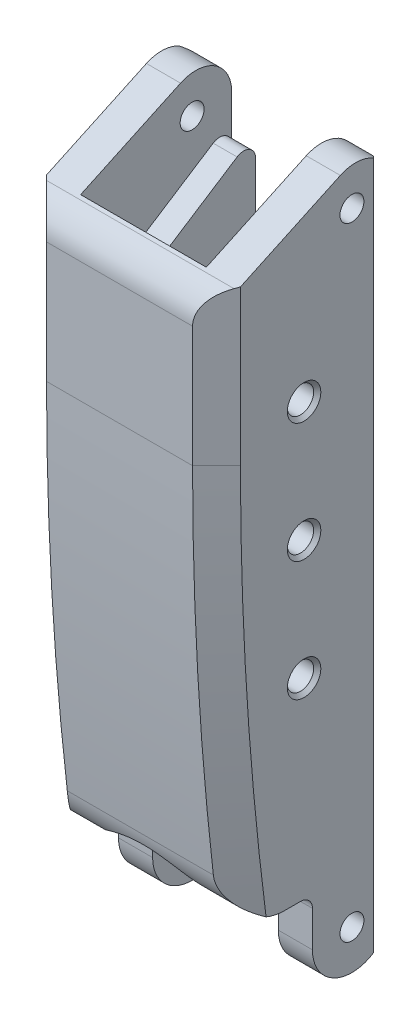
ISO-10303-21;
HEADER;
FILE_DESCRIPTION(('STEP AP214'),'2;1');
FILE_NAME('part.step','',(''),(''),'','','');
FILE_SCHEMA(('AUTOMOTIVE_DESIGN { 1 0 10303 214 1 1 1 1 }'));
ENDSEC;
DATA;
#1=APPLICATION_CONTEXT('core data for automotive mechanical design processes');
#2=APPLICATION_PROTOCOL_DEFINITION('international standard','automotive_design',2000,#1);
#3=PRODUCT_CONTEXT('',#1,'mechanical');
#4=PRODUCT('Part','Part','',(#3));
#5=PRODUCT_RELATED_PRODUCT_CATEGORY('part','',(#4));
#6=PRODUCT_DEFINITION_FORMATION('','',#4);
#7=PRODUCT_DEFINITION_CONTEXT('part definition',#1,'design');
#8=PRODUCT_DEFINITION('design','',#6,#7);
#9=PRODUCT_DEFINITION_SHAPE('','',#8);
#10=(LENGTH_UNIT() NAMED_UNIT(*) SI_UNIT(.MILLI.,.METRE.));
#11=(NAMED_UNIT(*) PLANE_ANGLE_UNIT() SI_UNIT($,.RADIAN.));
#12=(NAMED_UNIT(*) SI_UNIT($,.STERADIAN.) SOLID_ANGLE_UNIT());
#13=UNCERTAINTY_MEASURE_WITH_UNIT(LENGTH_MEASURE(1.E-05),#10,'distance_accuracy_value','');
#14=(GEOMETRIC_REPRESENTATION_CONTEXT(3) GLOBAL_UNCERTAINTY_ASSIGNED_CONTEXT((#13)) GLOBAL_UNIT_ASSIGNED_CONTEXT((#10,
#11,#12)) REPRESENTATION_CONTEXT('',''));
#15=CARTESIAN_POINT('',(0.,0.,0.));
#16=DIRECTION('',(0.,0.,1.));
#17=DIRECTION('',(1.,0.,0.));
#18=AXIS2_PLACEMENT_3D('',#15,#16,#17);
#19=CARTESIAN_POINT('',(-8.1,40.,4.));
#20=DIRECTION('',(-1.,0.,0.));
#21=DIRECTION('',(0.,0.,1.));
#22=AXIS2_PLACEMENT_3D('',#19,#20,#21);
#23=CONICAL_SURFACE('',#22,1.4,0.785398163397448);
#24=CARTESIAN_POINT('',(-8.1,40.,4.));
#25=DIRECTION('',(1.,0.,0.));
#26=DIRECTION('',(0.,0.,-1.));
#27=AXIS2_PLACEMENT_3D('',#24,#25,#26);
#28=CIRCLE('',#27,1.4);
#29=CARTESIAN_POINT('',(-8.1,40.,2.6));
#30=VERTEX_POINT('',#29);
#31=EDGE_CURVE('E567',#30,#30,#28,.T.);
#32=ORIENTED_EDGE('',*,*,#31,.F.);
#33=EDGE_LOOP('',(#32));
#34=FACE_BOUND('',#33,.T.);
#35=CARTESIAN_POINT('',(-7.8,40.,4.));
#36=DIRECTION('',(-1.,0.,0.));
#37=DIRECTION('',(0.,0.,-1.));
#38=AXIS2_PLACEMENT_3D('',#35,#36,#37);
#39=CIRCLE('',#38,1.1);
#40=CARTESIAN_POINT('',(-7.8,40.,2.9));
#41=VERTEX_POINT('',#40);
#42=EDGE_CURVE('E28',#41,#41,#39,.T.);
#43=ORIENTED_EDGE('',*,*,#42,.F.);
#44=EDGE_LOOP('',(#43));
#45=FACE_BOUND('',#44,.T.);
#46=ADVANCED_FACE('F17',(#34,#45),#23,.F.);
#47=CARTESIAN_POINT('',(-8.1,20.,4.));
#48=DIRECTION('',(-1.,0.,0.));
#49=DIRECTION('',(0.,0.,1.));
#50=AXIS2_PLACEMENT_3D('',#47,#48,#49);
#51=CONICAL_SURFACE('',#50,1.4,0.785398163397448);
#52=CARTESIAN_POINT('',(-8.1,20.,4.));
#53=DIRECTION('',(1.,0.,0.));
#54=DIRECTION('',(0.,0.,-1.));
#55=AXIS2_PLACEMENT_3D('',#52,#53,#54);
#56=CIRCLE('',#55,1.4);
#57=CARTESIAN_POINT('',(-8.1,20.,2.6));
#58=VERTEX_POINT('',#57);
#59=EDGE_CURVE('E564',#58,#58,#56,.T.);
#60=ORIENTED_EDGE('',*,*,#59,.F.);
#61=EDGE_LOOP('',(#60));
#62=FACE_BOUND('',#61,.T.);
#63=CARTESIAN_POINT('',(-7.8,20.,4.));
#64=DIRECTION('',(-1.,0.,0.));
#65=DIRECTION('',(0.,0.,-1.));
#66=AXIS2_PLACEMENT_3D('',#63,#64,#65);
#67=CIRCLE('',#66,1.1);
#68=CARTESIAN_POINT('',(-7.8,20.,2.9));
#69=VERTEX_POINT('',#68);
#70=EDGE_CURVE('E793',#69,#69,#67,.T.);
#71=ORIENTED_EDGE('',*,*,#70,.F.);
#72=EDGE_LOOP('',(#71));
#73=FACE_BOUND('',#72,.T.);
#74=ADVANCED_FACE('F19',(#62,#73),#51,.F.);
#75=CARTESIAN_POINT('',(-8.1,30.,4.));
#76=DIRECTION('',(-1.,0.,0.));
#77=DIRECTION('',(0.,0.,1.));
#78=AXIS2_PLACEMENT_3D('',#75,#76,#77);
#79=CONICAL_SURFACE('',#78,1.4,0.785398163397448);
#80=CARTESIAN_POINT('',(-8.1,30.,4.));
#81=DIRECTION('',(1.,0.,0.));
#82=DIRECTION('',(0.,0.,-1.));
#83=AXIS2_PLACEMENT_3D('',#80,#81,#82);
#84=CIRCLE('',#83,1.4);
#85=CARTESIAN_POINT('',(-8.1,30.,2.6));
#86=VERTEX_POINT('',#85);
#87=EDGE_CURVE('E568',#86,#86,#84,.T.);
#88=ORIENTED_EDGE('',*,*,#87,.F.);
#89=EDGE_LOOP('',(#88));
#90=FACE_BOUND('',#89,.T.);
#91=CARTESIAN_POINT('',(-7.8,30.,4.));
#92=DIRECTION('',(-1.,0.,0.));
#93=DIRECTION('',(0.,0.,-1.));
#94=AXIS2_PLACEMENT_3D('',#91,#92,#93);
#95=CIRCLE('',#94,1.1);
#96=CARTESIAN_POINT('',(-7.8,30.,2.9));
#97=VERTEX_POINT('',#96);
#98=EDGE_CURVE('E11',#97,#97,#95,.T.);
#99=ORIENTED_EDGE('',*,*,#98,.F.);
#100=EDGE_LOOP('',(#99));
#101=FACE_BOUND('',#100,.T.);
#102=ADVANCED_FACE('F914',(#90,#101),#79,.F.);
#103=CARTESIAN_POINT('',(8.1,40.,4.));
#104=DIRECTION('',(1.,0.,0.));
#105=DIRECTION('',(0.,0.,-1.));
#106=AXIS2_PLACEMENT_3D('',#103,#104,#105);
#107=CONICAL_SURFACE('',#106,1.4,0.785398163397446);
#108=CARTESIAN_POINT('',(8.1,40.,4.));
#109=DIRECTION('',(-1.,0.,0.));
#110=DIRECTION('',(0.,0.,-1.));
#111=AXIS2_PLACEMENT_3D('',#108,#109,#110);
#112=CIRCLE('',#111,1.4);
#113=CARTESIAN_POINT('',(8.1,40.,2.6));
#114=VERTEX_POINT('',#113);
#115=EDGE_CURVE('E697',#114,#114,#112,.T.);
#116=ORIENTED_EDGE('',*,*,#115,.F.);
#117=EDGE_LOOP('',(#116));
#118=FACE_BOUND('',#117,.T.);
#119=CARTESIAN_POINT('',(7.8,40.,4.));
#120=DIRECTION('',(1.,0.,0.));
#121=DIRECTION('',(0.,0.,-1.));
#122=AXIS2_PLACEMENT_3D('',#119,#120,#121);
#123=CIRCLE('',#122,1.1);
#124=CARTESIAN_POINT('',(7.8,40.,2.9));
#125=VERTEX_POINT('',#124);
#126=EDGE_CURVE('E319',#125,#125,#123,.T.);
#127=ORIENTED_EDGE('',*,*,#126,.F.);
#128=EDGE_LOOP('',(#127));
#129=FACE_BOUND('',#128,.T.);
#130=ADVANCED_FACE('F910',(#118,#129),#107,.F.);
#131=CARTESIAN_POINT('',(8.1,20.,4.));
#132=DIRECTION('',(1.,0.,0.));
#133=DIRECTION('',(0.,0.,-1.));
#134=AXIS2_PLACEMENT_3D('',#131,#132,#133);
#135=CONICAL_SURFACE('',#134,1.4,0.785398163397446);
#136=CARTESIAN_POINT('',(8.1,20.,4.));
#137=DIRECTION('',(-1.,0.,0.));
#138=DIRECTION('',(0.,0.,-1.));
#139=AXIS2_PLACEMENT_3D('',#136,#137,#138);
#140=CIRCLE('',#139,1.4);
#141=CARTESIAN_POINT('',(8.1,20.,2.6));
#142=VERTEX_POINT('',#141);
#143=EDGE_CURVE('E694',#142,#142,#140,.T.);
#144=ORIENTED_EDGE('',*,*,#143,.F.);
#145=EDGE_LOOP('',(#144));
#146=FACE_BOUND('',#145,.T.);
#147=CARTESIAN_POINT('',(7.8,20.,4.));
#148=DIRECTION('',(1.,0.,0.));
#149=DIRECTION('',(0.,0.,-1.));
#150=AXIS2_PLACEMENT_3D('',#147,#148,#149);
#151=CIRCLE('',#150,1.1);
#152=CARTESIAN_POINT('',(7.8,20.,2.9));
#153=VERTEX_POINT('',#152);
#154=EDGE_CURVE('E786',#153,#153,#151,.T.);
#155=ORIENTED_EDGE('',*,*,#154,.F.);
#156=EDGE_LOOP('',(#155));
#157=FACE_BOUND('',#156,.T.);
#158=ADVANCED_FACE('F913',(#146,#157),#135,.F.);
#159=CARTESIAN_POINT('',(8.1,30.,4.));
#160=DIRECTION('',(1.,0.,0.));
#161=DIRECTION('',(0.,0.,-1.));
#162=AXIS2_PLACEMENT_3D('',#159,#160,#161);
#163=CONICAL_SURFACE('',#162,1.4,0.785398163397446);
#164=CARTESIAN_POINT('',(8.1,30.,4.));
#165=DIRECTION('',(-1.,0.,0.));
#166=DIRECTION('',(0.,0.,-1.));
#167=AXIS2_PLACEMENT_3D('',#164,#165,#166);
#168=CIRCLE('',#167,1.4);
#169=CARTESIAN_POINT('',(8.1,30.,2.6));
#170=VERTEX_POINT('',#169);
#171=EDGE_CURVE('E693',#170,#170,#168,.T.);
#172=ORIENTED_EDGE('',*,*,#171,.F.);
#173=EDGE_LOOP('',(#172));
#174=FACE_BOUND('',#173,.T.);
#175=CARTESIAN_POINT('',(7.8,30.,4.));
#176=DIRECTION('',(1.,0.,0.));
#177=DIRECTION('',(0.,0.,-1.));
#178=AXIS2_PLACEMENT_3D('',#175,#176,#177);
#179=CIRCLE('',#178,1.1);
#180=CARTESIAN_POINT('',(7.8,30.,2.9));
#181=VERTEX_POINT('',#180);
#182=EDGE_CURVE('E307',#181,#181,#179,.T.);
#183=ORIENTED_EDGE('',*,*,#182,.F.);
#184=EDGE_LOOP('',(#183));
#185=FACE_BOUND('',#184,.T.);
#186=ADVANCED_FACE('F1164',(#174,#185),#163,.F.);
#187=CARTESIAN_POINT('',(-8.1,30.,4.));
#188=DIRECTION('',(1.,0.,0.));
#189=DIRECTION('',(0.,0.,-1.));
#190=AXIS2_PLACEMENT_3D('',#187,#188,#189);
#191=CYLINDRICAL_SURFACE('',#190,1.1);
#192=CARTESIAN_POINT('',(-3.25,30.,4.));
#193=DIRECTION('',(-1.,0.,0.));
#194=DIRECTION('',(0.,0.,-1.));
#195=AXIS2_PLACEMENT_3D('',#192,#193,#194);
#196=CIRCLE('',#195,1.1);
#197=CARTESIAN_POINT('',(-3.25,30.,2.9));
#198=VERTEX_POINT('',#197);
#199=EDGE_CURVE('E597',#198,#198,#196,.T.);
#200=ORIENTED_EDGE('',*,*,#199,.F.);
#201=EDGE_LOOP('',(#200));
#202=FACE_BOUND('',#201,.T.);
#203=ORIENTED_EDGE('',*,*,#98,.T.);
#204=EDGE_LOOP('',(#203));
#205=FACE_BOUND('',#204,.T.);
#206=ADVANCED_FACE('F1152',(#202,#205),#191,.F.);
#207=CARTESIAN_POINT('',(-8.1,40.,4.));
#208=DIRECTION('',(1.,0.,0.));
#209=DIRECTION('',(0.,0.,-1.));
#210=AXIS2_PLACEMENT_3D('',#207,#208,#209);
#211=CYLINDRICAL_SURFACE('',#210,1.1);
#212=CARTESIAN_POINT('',(-3.25,40.,4.));
#213=DIRECTION('',(-1.,0.,0.));
#214=DIRECTION('',(0.,0.,-1.));
#215=AXIS2_PLACEMENT_3D('',#212,#213,#214);
#216=CIRCLE('',#215,1.1);
#217=CARTESIAN_POINT('',(-3.25,40.,2.9));
#218=VERTEX_POINT('',#217);
#219=EDGE_CURVE('E751',#218,#218,#216,.T.);
#220=ORIENTED_EDGE('',*,*,#219,.F.);
#221=EDGE_LOOP('',(#220));
#222=FACE_BOUND('',#221,.T.);
#223=ORIENTED_EDGE('',*,*,#42,.T.);
#224=EDGE_LOOP('',(#223));
#225=FACE_BOUND('',#224,.T.);
#226=ADVANCED_FACE('F1148',(#222,#225),#211,.F.);
#227=CARTESIAN_POINT('',(-8.1,20.,4.));
#228=DIRECTION('',(1.,0.,0.));
#229=DIRECTION('',(0.,0.,-1.));
#230=AXIS2_PLACEMENT_3D('',#227,#228,#229);
#231=CYLINDRICAL_SURFACE('',#230,1.1);
#232=CARTESIAN_POINT('',(-3.25,20.,4.));
#233=DIRECTION('',(-1.,0.,0.));
#234=DIRECTION('',(0.,0.,-1.));
#235=AXIS2_PLACEMENT_3D('',#232,#233,#234);
#236=CIRCLE('',#235,1.1);
#237=CARTESIAN_POINT('',(-3.25,20.,2.9));
#238=VERTEX_POINT('',#237);
#239=EDGE_CURVE('E755',#238,#238,#236,.T.);
#240=ORIENTED_EDGE('',*,*,#239,.F.);
#241=EDGE_LOOP('',(#240));
#242=FACE_BOUND('',#241,.T.);
#243=ORIENTED_EDGE('',*,*,#70,.T.);
#244=EDGE_LOOP('',(#243));
#245=FACE_BOUND('',#244,.T.);
#246=ADVANCED_FACE('F1151',(#242,#245),#231,.F.);
#247=CARTESIAN_POINT('',(-8.1,30.,4.));
#248=DIRECTION('',(1.,0.,0.));
#249=DIRECTION('',(0.,0.,-1.));
#250=AXIS2_PLACEMENT_3D('',#247,#248,#249);
#251=CYLINDRICAL_SURFACE('',#250,1.1);
#252=CARTESIAN_POINT('',(3.25,30.,4.));
#253=DIRECTION('',(1.,0.,0.));
#254=DIRECTION('',(0.,0.,1.));
#255=AXIS2_PLACEMENT_3D('',#252,#253,#254);
#256=CIRCLE('',#255,1.1);
#257=CARTESIAN_POINT('',(3.25,30.,5.1));
#258=VERTEX_POINT('',#257);
#259=EDGE_CURVE('E771',#258,#258,#256,.T.);
#260=ORIENTED_EDGE('',*,*,#259,.F.);
#261=EDGE_LOOP('',(#260));
#262=FACE_BOUND('',#261,.T.);
#263=ORIENTED_EDGE('',*,*,#182,.T.);
#264=EDGE_LOOP('',(#263));
#265=FACE_BOUND('',#264,.T.);
#266=ADVANCED_FACE('F1161',(#262,#265),#251,.F.);
#267=CARTESIAN_POINT('',(-8.1,40.,4.));
#268=DIRECTION('',(1.,0.,0.));
#269=DIRECTION('',(0.,0.,-1.));
#270=AXIS2_PLACEMENT_3D('',#267,#268,#269);
#271=CYLINDRICAL_SURFACE('',#270,1.1);
#272=CARTESIAN_POINT('',(3.25,40.,4.));
#273=DIRECTION('',(1.,0.,0.));
#274=DIRECTION('',(0.,0.,1.));
#275=AXIS2_PLACEMENT_3D('',#272,#273,#274);
#276=CIRCLE('',#275,1.1);
#277=CARTESIAN_POINT('',(3.25,40.,5.1));
#278=VERTEX_POINT('',#277);
#279=EDGE_CURVE('E774',#278,#278,#276,.T.);
#280=ORIENTED_EDGE('',*,*,#279,.F.);
#281=EDGE_LOOP('',(#280));
#282=FACE_BOUND('',#281,.T.);
#283=ORIENTED_EDGE('',*,*,#126,.T.);
#284=EDGE_LOOP('',(#283));
#285=FACE_BOUND('',#284,.T.);
#286=ADVANCED_FACE('F1567',(#282,#285),#271,.F.);
#287=CARTESIAN_POINT('',(-8.1,20.,4.));
#288=DIRECTION('',(1.,0.,0.));
#289=DIRECTION('',(0.,0.,-1.));
#290=AXIS2_PLACEMENT_3D('',#287,#288,#289);
#291=CYLINDRICAL_SURFACE('',#290,1.1);
#292=CARTESIAN_POINT('',(3.25,20.,4.));
#293=DIRECTION('',(1.,0.,0.));
#294=DIRECTION('',(0.,0.,1.));
#295=AXIS2_PLACEMENT_3D('',#292,#293,#294);
#296=CIRCLE('',#295,1.1);
#297=CARTESIAN_POINT('',(3.25,20.,5.1));
#298=VERTEX_POINT('',#297);
#299=EDGE_CURVE('E777',#298,#298,#296,.T.);
#300=ORIENTED_EDGE('',*,*,#299,.F.);
#301=EDGE_LOOP('',(#300));
#302=FACE_BOUND('',#301,.T.);
#303=ORIENTED_EDGE('',*,*,#154,.T.);
#304=EDGE_LOOP('',(#303));
#305=FACE_BOUND('',#304,.T.);
#306=ADVANCED_FACE('F1558',(#302,#305),#291,.F.);
#307=CARTESIAN_POINT('',(-3.25,48.3161282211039,-2.3));
#308=DIRECTION('',(-1.,0.,0.));
#309=DIRECTION('',(0.,0.,1.));
#310=AXIS2_PLACEMENT_3D('',#307,#308,#309);
#311=CYLINDRICAL_SURFACE('',#310,1.);
#312=CARTESIAN_POINT('',(-3.25,48.3161282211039,-2.3));
#313=DIRECTION('',(1.,0.,0.));
#314=DIRECTION('',(0.,0.,-1.));
#315=AXIS2_PLACEMENT_3D('',#312,#313,#314);
#316=CIRCLE('',#315,1.);
#317=CARTESIAN_POINT('',(-3.25,48.3161282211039,-3.3));
#318=VERTEX_POINT('',#317);
#319=CARTESIAN_POINT('',(-3.25,49.1562947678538,-1.75767152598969));
#320=VERTEX_POINT('',#319);
#321=EDGE_CURVE('E761',#318,#320,#316,.T.);
#322=ORIENTED_EDGE('',*,*,#321,.F.);
#323=DIRECTION('',(1.,0.,0.));
#324=VECTOR('',#323,1.);
#325=CARTESIAN_POINT('',(8.1,48.3161282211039,-3.3));
#326=LINE('',#325,#324);
#327=CARTESIAN_POINT('',(-5.25,48.3161282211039,-3.3));
#328=VERTEX_POINT('',#327);
#329=EDGE_CURVE('E472',#328,#318,#326,.T.);
#330=ORIENTED_EDGE('',*,*,#329,.F.);
#331=CARTESIAN_POINT('',(-5.25,48.3161282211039,-2.3));
#332=DIRECTION('',(-1.,0.,0.));
#333=DIRECTION('',(0.,0.,-1.));
#334=AXIS2_PLACEMENT_3D('',#331,#332,#333);
#335=CIRCLE('',#334,1.);
#336=CARTESIAN_POINT('',(-5.25,49.1562947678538,-1.75767152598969));
#337=VERTEX_POINT('',#336);
#338=EDGE_CURVE('E995',#337,#328,#335,.T.);
#339=ORIENTED_EDGE('',*,*,#338,.F.);
#340=DIRECTION('',(-1.,0.,0.));
#341=VECTOR('',#340,1.);
#342=CARTESIAN_POINT('',(-3.25,49.1562947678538,-1.75767152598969));
#343=LINE('',#342,#341);
#344=EDGE_CURVE('E744',#320,#337,#343,.T.);
#345=ORIENTED_EDGE('',*,*,#344,.F.);
#346=EDGE_LOOP('',(#322,#330,#339,#345));
#347=FACE_BOUND('',#346,.T.);
#348=ADVANCED_FACE('F1549',(#347),#311,.T.);
#349=CARTESIAN_POINT('',(8.1,48.3161282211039,-2.3));
#350=DIRECTION('',(-1.,0.,0.));
#351=DIRECTION('',(0.,0.,1.));
#352=AXIS2_PLACEMENT_3D('',#349,#350,#351);
#353=CYLINDRICAL_SURFACE('',#352,1.);
#354=CARTESIAN_POINT('',(3.25,48.3161282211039,-2.3));
#355=DIRECTION('',(-1.,0.,0.));
#356=DIRECTION('',(0.,0.,1.));
#357=AXIS2_PLACEMENT_3D('',#354,#355,#356);
#358=CIRCLE('',#357,1.);
#359=CARTESIAN_POINT('',(3.25,49.1562947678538,-1.75767152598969));
#360=VERTEX_POINT('',#359);
#361=CARTESIAN_POINT('',(3.25,48.3161282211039,-3.3));
#362=VERTEX_POINT('',#361);
#363=EDGE_CURVE('E783',#360,#362,#358,.T.);
#364=ORIENTED_EDGE('',*,*,#363,.F.);
#365=DIRECTION('',(-1.,0.,0.));
#366=VECTOR('',#365,1.);
#367=CARTESIAN_POINT('',(3.25,49.1562947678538,-1.75767152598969));
#368=LINE('',#367,#366);
#369=CARTESIAN_POINT('',(5.25,49.1562947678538,-1.75767152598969));
#370=VERTEX_POINT('',#369);
#371=EDGE_CURVE('E602',#370,#360,#368,.T.);
#372=ORIENTED_EDGE('',*,*,#371,.F.);
#373=CARTESIAN_POINT('',(5.25,48.3161282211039,-2.3));
#374=DIRECTION('',(1.,0.,0.));
#375=DIRECTION('',(0.,0.,-1.));
#376=AXIS2_PLACEMENT_3D('',#373,#374,#375);
#377=CIRCLE('',#376,1.);
#378=CARTESIAN_POINT('',(5.25,48.3161282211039,-3.3));
#379=VERTEX_POINT('',#378);
#380=EDGE_CURVE('E649',#379,#370,#377,.T.);
#381=ORIENTED_EDGE('',*,*,#380,.F.);
#382=DIRECTION('',(1.,0.,0.));
#383=VECTOR('',#382,1.);
#384=CARTESIAN_POINT('',(5.25,48.3161282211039,-3.3));
#385=LINE('',#384,#383);
#386=EDGE_CURVE('E495',#362,#379,#385,.T.);
#387=ORIENTED_EDGE('',*,*,#386,.F.);
#388=EDGE_LOOP('',(#364,#372,#381,#387));
#389=FACE_BOUND('',#388,.T.);
#390=ADVANCED_FACE('F1540',(#389),#353,.T.);
#391=CARTESIAN_POINT('',(-3.25,12.2784777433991,-2.3));
#392=DIRECTION('',(-1.,0.,0.));
#393=DIRECTION('',(0.,0.,1.));
#394=AXIS2_PLACEMENT_3D('',#391,#392,#393);
#395=CYLINDRICAL_SURFACE('',#394,1.);
#396=CARTESIAN_POINT('',(-3.25,12.2784777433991,-2.3));
#397=DIRECTION('',(1.,0.,0.));
#398=DIRECTION('',(0.,0.,-1.));
#399=AXIS2_PLACEMENT_3D('',#396,#397,#398);
#400=CIRCLE('',#399,1.);
#401=CARTESIAN_POINT('',(-3.25,11.2850991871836,-2.4148870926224));
#402=VERTEX_POINT('',#401);
#403=CARTESIAN_POINT('',(-3.25,12.2784777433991,-3.3));
#404=VERTEX_POINT('',#403);
#405=EDGE_CURVE('E758',#402,#404,#400,.T.);
#406=ORIENTED_EDGE('',*,*,#405,.F.);
#407=DIRECTION('',(1.,0.,0.));
#408=VECTOR('',#407,1.);
#409=CARTESIAN_POINT('',(-3.25,11.2850991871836,-2.4148870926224));
#410=LINE('',#409,#408);
#411=CARTESIAN_POINT('',(-5.25,11.2850991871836,-2.4148870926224));
#412=VERTEX_POINT('',#411);
#413=EDGE_CURVE('E598',#412,#402,#410,.T.);
#414=ORIENTED_EDGE('',*,*,#413,.F.);
#415=CARTESIAN_POINT('',(-5.25,12.2784777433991,-2.3));
#416=DIRECTION('',(-1.,0.,0.));
#417=DIRECTION('',(0.,0.,-1.));
#418=AXIS2_PLACEMENT_3D('',#415,#416,#417);
#419=CIRCLE('',#418,1.);
#420=CARTESIAN_POINT('',(-5.25,12.2784777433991,-3.3));
#421=VERTEX_POINT('',#420);
#422=EDGE_CURVE('E678',#421,#412,#419,.T.);
#423=ORIENTED_EDGE('',*,*,#422,.F.);
#424=DIRECTION('',(-1.,0.,0.));
#425=VECTOR('',#424,1.);
#426=CARTESIAN_POINT('',(-5.25,12.2784777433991,-3.3));
#427=LINE('',#426,#425);
#428=EDGE_CURVE('E1010',#404,#421,#427,.T.);
#429=ORIENTED_EDGE('',*,*,#428,.F.);
#430=EDGE_LOOP('',(#406,#414,#423,#429));
#431=FACE_BOUND('',#430,.T.);
#432=ADVANCED_FACE('F1464',(#431),#395,.T.);
#433=CARTESIAN_POINT('',(3.25,12.2784777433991,-2.3));
#434=DIRECTION('',(1.,0.,0.));
#435=DIRECTION('',(0.,0.,-1.));
#436=AXIS2_PLACEMENT_3D('',#433,#434,#435);
#437=CYLINDRICAL_SURFACE('',#436,1.);
#438=CARTESIAN_POINT('',(3.25,12.2784777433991,-2.3));
#439=DIRECTION('',(-1.,0.,0.));
#440=DIRECTION('',(0.,0.,1.));
#441=AXIS2_PLACEMENT_3D('',#438,#439,#440);
#442=CIRCLE('',#441,1.);
#443=CARTESIAN_POINT('',(3.25,12.2784777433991,-3.3));
#444=VERTEX_POINT('',#443);
#445=CARTESIAN_POINT('',(3.25,11.2850991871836,-2.4148870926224));
#446=VERTEX_POINT('',#445);
#447=EDGE_CURVE('E780',#444,#446,#442,.T.);
#448=ORIENTED_EDGE('',*,*,#447,.F.);
#449=DIRECTION('',(-1.,0.,0.));
#450=VECTOR('',#449,1.);
#451=CARTESIAN_POINT('',(8.1,12.2784777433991,-3.3));
#452=LINE('',#451,#450);
#453=CARTESIAN_POINT('',(5.25,12.2784777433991,-3.3));
#454=VERTEX_POINT('',#453);
#455=EDGE_CURVE('E490',#454,#444,#452,.T.);
#456=ORIENTED_EDGE('',*,*,#455,.F.);
#457=CARTESIAN_POINT('',(5.25,12.2784777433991,-2.3));
#458=DIRECTION('',(1.,0.,0.));
#459=DIRECTION('',(0.,0.,-1.));
#460=AXIS2_PLACEMENT_3D('',#457,#458,#459);
#461=CIRCLE('',#460,1.);
#462=CARTESIAN_POINT('',(5.25,11.2850991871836,-2.4148870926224));
#463=VERTEX_POINT('',#462);
#464=EDGE_CURVE('E1054',#463,#454,#461,.T.);
#465=ORIENTED_EDGE('',*,*,#464,.F.);
#466=DIRECTION('',(1.,0.,0.));
#467=VECTOR('',#466,1.);
#468=CARTESIAN_POINT('',(3.25,11.2850991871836,-2.4148870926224));
#469=LINE('',#468,#467);
#470=EDGE_CURVE('E599',#446,#463,#469,.T.);
#471=ORIENTED_EDGE('',*,*,#470,.F.);
#472=EDGE_LOOP('',(#448,#456,#465,#471));
#473=FACE_BOUND('',#472,.T.);
#474=ADVANCED_FACE('F929',(#473),#437,.T.);
#475=CARTESIAN_POINT('',(3.25,25.9199461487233,3.00751952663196));
#476=DIRECTION('',(-1.,0.,0.));
#477=DIRECTION('',(0.,0.,1.));
#478=AXIS2_PLACEMENT_3D('',#475,#476,#477);
#479=PLANE('',#478);
#480=DIRECTION('',(0.,1.,0.));
#481=VECTOR('',#480,1.);
#482=CARTESIAN_POINT('',(3.25,28.4244745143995,-3.3));
#483=LINE('',#482,#481);
#484=EDGE_CURVE('E493',#444,#362,#483,.T.);
#485=ORIENTED_EDGE('',*,*,#484,.F.);
#486=ORIENTED_EDGE('',*,*,#447,.T.);
#487=CARTESIAN_POINT('',(3.25,3.63191411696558,-3.3));
#488=DIRECTION('',(1.,0.,0.));
#489=DIRECTION('',(0.,0.,-1.));
#490=AXIS2_PLACEMENT_3D('',#487,#488,#489);
#491=CIRCLE('',#490,7.70419798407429);
#492=CARTESIAN_POINT('',(3.25,7.60616455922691,3.3));
#493=VERTEX_POINT('',#492);
#494=EDGE_CURVE('E603',#446,#493,#491,.T.);
#495=ORIENTED_EDGE('',*,*,#494,.T.);
#496=CARTESIAN_POINT('',(3.25,49.1352497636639,-137.055216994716));
#497=DIRECTION('',(1.,0.,0.));
#498=DIRECTION('',(0.,0.,-1.));
#499=AXIS2_PLACEMENT_3D('',#496,#497,#498);
#500=CIRCLE('',#499,146.37025604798);
#501=CARTESIAN_POINT('',(3.25,42.1175046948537,9.14670881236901));
#502=VERTEX_POINT('',#501);
#503=EDGE_CURVE('E1103',#502,#493,#500,.T.);
#504=ORIENTED_EDGE('',*,*,#503,.F.);
#505=DIRECTION('',(0.,-0.542328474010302,0.840166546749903));
#506=VECTOR('',#505,1.);
#507=CARTESIAN_POINT('',(3.25,46.1346871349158,2.92335440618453));
#508=LINE('',#507,#506);
#509=EDGE_CURVE('E767',#360,#502,#508,.T.);
#510=ORIENTED_EDGE('',*,*,#509,.F.);
#511=ORIENTED_EDGE('',*,*,#363,.T.);
#512=EDGE_LOOP('',(#485,#486,#495,#504,#510,#511));
#513=FACE_BOUND('',#512,.T.);
#514=ORIENTED_EDGE('',*,*,#299,.T.);
#515=EDGE_LOOP('',(#514));
#516=FACE_BOUND('',#515,.T.);
#517=ORIENTED_EDGE('',*,*,#279,.T.);
#518=EDGE_LOOP('',(#517));
#519=FACE_BOUND('',#518,.T.);
#520=ORIENTED_EDGE('',*,*,#259,.T.);
#521=EDGE_LOOP('',(#520));
#522=FACE_BOUND('',#521,.T.);
#523=ADVANCED_FACE('F1463',(#513,#516,#519,#522),#479,.T.);
#524=CARTESIAN_POINT('',(3.25,46.1346871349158,2.92335440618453));
#525=DIRECTION('',(0.,0.840166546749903,0.542328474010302));
#526=DIRECTION('',(1.,0.,0.));
#527=AXIS2_PLACEMENT_3D('',#524,#525,#526);
#528=PLANE('',#527);
#529=DIRECTION('',(0.,-0.542328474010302,0.840166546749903));
#530=VECTOR('',#529,1.);
#531=CARTESIAN_POINT('',(5.25,46.1346871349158,2.92335440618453));
#532=LINE('',#531,#530);
#533=CARTESIAN_POINT('',(5.25,42.1175046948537,9.14670881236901));
#534=VERTEX_POINT('',#533);
#535=EDGE_CURVE('E644',#370,#534,#532,.T.);
#536=ORIENTED_EDGE('',*,*,#535,.F.);
#537=ORIENTED_EDGE('',*,*,#371,.T.);
#538=ORIENTED_EDGE('',*,*,#509,.T.);
#539=DIRECTION('',(1.,0.,0.));
#540=VECTOR('',#539,1.);
#541=CARTESIAN_POINT('',(3.25,42.1175046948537,9.14670881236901));
#542=LINE('',#541,#540);
#543=EDGE_CURVE('E1107',#502,#534,#542,.T.);
#544=ORIENTED_EDGE('',*,*,#543,.T.);
#545=EDGE_LOOP('',(#536,#537,#538,#544));
#546=FACE_BOUND('',#545,.T.);
#547=ADVANCED_FACE('F1133',(#546),#528,.T.);
#548=CARTESIAN_POINT('',(3.25,3.63191411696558,-3.3));
#549=DIRECTION('',(1.,0.,0.));
#550=DIRECTION('',(0.,0.,-1.));
#551=AXIS2_PLACEMENT_3D('',#548,#549,#550);
#552=CYLINDRICAL_SURFACE('',#551,7.70419798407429);
#553=ORIENTED_EDGE('',*,*,#494,.F.);
#554=ORIENTED_EDGE('',*,*,#470,.T.);
#555=CARTESIAN_POINT('',(5.25,3.63191411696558,-3.3));
#556=DIRECTION('',(1.,0.,0.));
#557=DIRECTION('',(0.,0.,-1.));
#558=AXIS2_PLACEMENT_3D('',#555,#556,#557);
#559=CIRCLE('',#558,7.70419798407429);
#560=CARTESIAN_POINT('',(5.25,7.60616455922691,3.3));
#561=VERTEX_POINT('',#560);
#562=EDGE_CURVE('E1058',#463,#561,#559,.T.);
#563=ORIENTED_EDGE('',*,*,#562,.T.);
#564=DIRECTION('',(1.,0.,0.));
#565=VECTOR('',#564,1.);
#566=CARTESIAN_POINT('',(3.25,7.60616455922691,3.3));
#567=LINE('',#566,#565);
#568=EDGE_CURVE('E613',#493,#561,#567,.T.);
#569=ORIENTED_EDGE('',*,*,#568,.F.);
#570=EDGE_LOOP('',(#553,#554,#563,#569));
#571=FACE_BOUND('',#570,.T.);
#572=ADVANCED_FACE('F1203',(#571),#552,.F.);
#573=CARTESIAN_POINT('',(-3.25,25.9199461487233,3.00751952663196));
#574=DIRECTION('',(1.,0.,0.));
#575=DIRECTION('',(0.,1.,0.));
#576=AXIS2_PLACEMENT_3D('',#573,#574,#575);
#577=PLANE('',#576);
#578=CARTESIAN_POINT('',(-3.25,3.63191411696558,-3.3));
#579=DIRECTION('',(1.,0.,0.));
#580=DIRECTION('',(0.,0.,-1.));
#581=AXIS2_PLACEMENT_3D('',#578,#579,#580);
#582=CIRCLE('',#581,7.70419798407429);
#583=CARTESIAN_POINT('',(-3.25,7.60616455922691,3.3));
#584=VERTEX_POINT('',#583);
#585=EDGE_CURVE('E594',#402,#584,#582,.T.);
#586=ORIENTED_EDGE('',*,*,#585,.F.);
#587=ORIENTED_EDGE('',*,*,#405,.T.);
#588=DIRECTION('',(0.,1.,0.));
#589=VECTOR('',#588,1.);
#590=CARTESIAN_POINT('',(-3.25,28.4244745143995,-3.3));
#591=LINE('',#590,#589);
#592=EDGE_CURVE('E1007',#404,#318,#591,.T.);
#593=ORIENTED_EDGE('',*,*,#592,.T.);
#594=ORIENTED_EDGE('',*,*,#321,.T.);
#595=DIRECTION('',(0.,-0.542328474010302,0.840166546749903));
#596=VECTOR('',#595,1.);
#597=CARTESIAN_POINT('',(-3.25,46.1346871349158,2.92335440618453));
#598=LINE('',#597,#596);
#599=CARTESIAN_POINT('',(-3.25,42.1175046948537,9.14670881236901));
#600=VERTEX_POINT('',#599);
#601=EDGE_CURVE('E741',#320,#600,#598,.T.);
#602=ORIENTED_EDGE('',*,*,#601,.T.);
#603=CARTESIAN_POINT('',(-3.25,49.1352497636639,-137.055216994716));
#604=DIRECTION('',(1.,0.,0.));
#605=DIRECTION('',(0.,0.,-1.));
#606=AXIS2_PLACEMENT_3D('',#603,#604,#605);
#607=CIRCLE('',#606,146.37025604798);
#608=EDGE_CURVE('E1088',#600,#584,#607,.T.);
#609=ORIENTED_EDGE('',*,*,#608,.T.);
#610=EDGE_LOOP('',(#586,#587,#593,#594,#602,#609));
#611=FACE_BOUND('',#610,.T.);
#612=ORIENTED_EDGE('',*,*,#239,.T.);
#613=EDGE_LOOP('',(#612));
#614=FACE_BOUND('',#613,.T.);
#615=ORIENTED_EDGE('',*,*,#219,.T.);
#616=EDGE_LOOP('',(#615));
#617=FACE_BOUND('',#616,.T.);
#618=ORIENTED_EDGE('',*,*,#199,.T.);
#619=EDGE_LOOP('',(#618));
#620=FACE_BOUND('',#619,.T.);
#621=ADVANCED_FACE('F1145',(#611,#614,#617,#620),#577,.T.);
#622=CARTESIAN_POINT('',(-3.25,3.63191411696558,-3.3));
#623=DIRECTION('',(-1.,0.,0.));
#624=DIRECTION('',(0.,0.,1.));
#625=AXIS2_PLACEMENT_3D('',#622,#623,#624);
#626=CYLINDRICAL_SURFACE('',#625,7.70419798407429);
#627=CARTESIAN_POINT('',(-5.25,3.63191411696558,-3.3));
#628=DIRECTION('',(1.,0.,0.));
#629=DIRECTION('',(0.,0.,-1.));
#630=AXIS2_PLACEMENT_3D('',#627,#628,#629);
#631=CIRCLE('',#630,7.70419798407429);
#632=CARTESIAN_POINT('',(-5.25,7.60616455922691,3.3));
#633=VERTEX_POINT('',#632);
#634=EDGE_CURVE('E674',#412,#633,#631,.T.);
#635=ORIENTED_EDGE('',*,*,#634,.F.);
#636=ORIENTED_EDGE('',*,*,#413,.T.);
#637=ORIENTED_EDGE('',*,*,#585,.T.);
#638=DIRECTION('',(1.,0.,0.));
#639=VECTOR('',#638,1.);
#640=CARTESIAN_POINT('',(-5.25,7.60616455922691,3.3));
#641=LINE('',#640,#639);
#642=EDGE_CURVE('E617',#633,#584,#641,.T.);
#643=ORIENTED_EDGE('',*,*,#642,.F.);
#644=EDGE_LOOP('',(#635,#636,#637,#643));
#645=FACE_BOUND('',#644,.T.);
#646=ADVANCED_FACE('F1202',(#645),#626,.F.);
#647=CARTESIAN_POINT('',(-3.25,46.1346871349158,2.92335440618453));
#648=DIRECTION('',(0.,-0.840166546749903,-0.542328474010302));
#649=DIRECTION('',(0.,0.542328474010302,-0.840166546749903));
#650=AXIS2_PLACEMENT_3D('',#647,#648,#649);
#651=PLANE('',#650);
#652=ORIENTED_EDGE('',*,*,#601,.F.);
#653=ORIENTED_EDGE('',*,*,#344,.T.);
#654=DIRECTION('',(0.,-0.542328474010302,0.840166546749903));
#655=VECTOR('',#654,1.);
#656=CARTESIAN_POINT('',(-5.25,46.1346871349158,2.92335440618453));
#657=LINE('',#656,#655);
#658=CARTESIAN_POINT('',(-5.25,42.1175046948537,9.14670881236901));
#659=VERTEX_POINT('',#658);
#660=EDGE_CURVE('E1025',#337,#659,#657,.T.);
#661=ORIENTED_EDGE('',*,*,#660,.T.);
#662=DIRECTION('',(-1.,0.,0.));
#663=VECTOR('',#662,1.);
#664=CARTESIAN_POINT('',(-3.25,42.1175046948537,9.14670881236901));
#665=LINE('',#664,#663);
#666=EDGE_CURVE('E1078',#600,#659,#665,.T.);
#667=ORIENTED_EDGE('',*,*,#666,.F.);
#668=EDGE_LOOP('',(#652,#653,#661,#667));
#669=FACE_BOUND('',#668,.T.);
#670=ADVANCED_FACE('F1499',(#669),#651,.F.);
#671=CARTESIAN_POINT('',(-6.6,28.4244745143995,-3.3));
#672=DIRECTION('',(0.707106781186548,0.,0.707106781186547));
#673=DIRECTION('',(0.,-1.,0.));
#674=AXIS2_PLACEMENT_3D('',#671,#672,#673);
#675=PLANE('',#674);
#676=CARTESIAN_POINT('',(-9.9,0.,0.));
#677=DIRECTION('',(0.707106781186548,0.,0.707106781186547));
#678=DIRECTION('',(-0.707106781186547,0.,0.707106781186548));
#679=AXIS2_PLACEMENT_3D('',#676,#677,#678);
#680=ELLIPSE('',#679,4.66690475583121,3.3);
#681=CARTESIAN_POINT('',(-8.1,-2.76586333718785,-1.8));
#682=VERTEX_POINT('',#681);
#683=CARTESIAN_POINT('',(-6.6,0.,-3.3));
#684=VERTEX_POINT('',#683);
#685=EDGE_CURVE('E535',#682,#684,#680,.T.);
#686=ORIENTED_EDGE('',*,*,#685,.F.);
#687=DIRECTION('',(0.,-1.,0.));
#688=VECTOR('',#687,1.);
#689=CARTESIAN_POINT('',(-8.1,26.7744745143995,-1.8));
#690=LINE('',#689,#688);
#691=CARTESIAN_POINT('',(-8.1,54.7379685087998,-1.8));
#692=VERTEX_POINT('',#691);
#693=EDGE_CURVE('E456',#692,#682,#690,.T.);
#694=ORIENTED_EDGE('',*,*,#693,.F.);
#695=CARTESIAN_POINT('',(-9.6,52.1398922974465,-0.299999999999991));
#696=DIRECTION('',(0.707106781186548,0.,0.707106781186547));
#697=DIRECTION('',(0.707106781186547,0.,-0.707106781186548));
#698=AXIS2_PLACEMENT_3D('',#695,#696,#697);
#699=ELLIPSE('',#698,4.24264068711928,3.);
#700=CARTESIAN_POINT('',(-6.6,52.1398922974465,-3.3));
#701=VERTEX_POINT('',#700);
#702=EDGE_CURVE('E449',#701,#692,#699,.T.);
#703=ORIENTED_EDGE('',*,*,#702,.F.);
#704=DIRECTION('',(0.,1.,0.));
#705=VECTOR('',#704,1.);
#706=CARTESIAN_POINT('',(-6.6,28.4244745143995,-3.3));
#707=LINE('',#706,#705);
#708=EDGE_CURVE('E454',#684,#701,#707,.T.);
#709=ORIENTED_EDGE('',*,*,#708,.F.);
#710=EDGE_LOOP('',(#686,#694,#703,#709));
#711=FACE_BOUND('',#710,.T.);
#712=ADVANCED_FACE('F452',(#711),#675,.F.);
#713=CARTESIAN_POINT('',(8.1,26.7744745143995,-1.8));
#714=DIRECTION('',(0.707106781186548,0.,-0.707106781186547));
#715=DIRECTION('',(0.,-1.,0.));
#716=AXIS2_PLACEMENT_3D('',#713,#714,#715);
#717=PLANE('',#716);
#718=CARTESIAN_POINT('',(9.9,0.,0.));
#719=DIRECTION('',(-0.707106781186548,0.,0.707106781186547));
#720=DIRECTION('',(-0.707106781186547,0.,-0.707106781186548));
#721=AXIS2_PLACEMENT_3D('',#718,#719,#720);
#722=ELLIPSE('',#721,4.66690475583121,3.3);
#723=CARTESIAN_POINT('',(6.6,0.,-3.3));
#724=VERTEX_POINT('',#723);
#725=CARTESIAN_POINT('',(8.1,-2.76586333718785,-1.8));
#726=VERTEX_POINT('',#725);
#727=EDGE_CURVE('E640',#724,#726,#722,.T.);
#728=ORIENTED_EDGE('',*,*,#727,.F.);
#729=DIRECTION('',(0.,-1.,0.));
#730=VECTOR('',#729,1.);
#731=CARTESIAN_POINT('',(6.6,0.,-3.3));
#732=LINE('',#731,#730);
#733=CARTESIAN_POINT('',(6.6,52.1398922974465,-3.3));
#734=VERTEX_POINT('',#733);
#735=EDGE_CURVE('E544',#734,#724,#732,.T.);
#736=ORIENTED_EDGE('',*,*,#735,.F.);
#737=CARTESIAN_POINT('',(9.6,52.1398922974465,-0.299999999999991));
#738=DIRECTION('',(-0.707106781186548,0.,0.707106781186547));
#739=DIRECTION('',(0.707106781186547,0.,0.707106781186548));
#740=AXIS2_PLACEMENT_3D('',#737,#738,#739);
#741=ELLIPSE('',#740,4.24264068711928,3.);
#742=CARTESIAN_POINT('',(8.1,54.7379685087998,-1.8));
#743=VERTEX_POINT('',#742);
#744=EDGE_CURVE('E461',#743,#734,#741,.T.);
#745=ORIENTED_EDGE('',*,*,#744,.F.);
#746=DIRECTION('',(0.,1.,0.));
#747=VECTOR('',#746,1.);
#748=CARTESIAN_POINT('',(8.1,52.1398922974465,-1.8));
#749=LINE('',#748,#747);
#750=EDGE_CURVE('E504',#726,#743,#749,.T.);
#751=ORIENTED_EDGE('',*,*,#750,.F.);
#752=EDGE_LOOP('',(#728,#736,#745,#751));
#753=FACE_BOUND('',#752,.T.);
#754=ADVANCED_FACE('F829',(#753),#717,.T.);
#755=CARTESIAN_POINT('',(8.1,8.,5.60463229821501));
#756=DIRECTION('',(-1.,0.,0.));
#757=DIRECTION('',(0.,0.,1.));
#758=AXIS2_PLACEMENT_3D('',#755,#756,#757);
#759=CYLINDRICAL_SURFACE('',#758,4.);
#760=CARTESIAN_POINT('',(6.10000000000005,7.54587832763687,9.57877038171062));
#761=CARTESIAN_POINT('',(6.09999738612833,7.49827300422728,9.57333323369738));
#762=CARTESIAN_POINT('',(6.10080446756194,7.45075918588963,9.56707858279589));
#763=CARTESIAN_POINT('',(6.10404883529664,7.35630272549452,9.55296820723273));
#764=CARTESIAN_POINT('',(6.10647682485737,7.30935837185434,9.54512178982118));
#765=CARTESIAN_POINT('',(6.1129624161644,7.21604280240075,9.52782932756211));
#766=CARTESIAN_POINT('',(6.11701448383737,7.16967018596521,9.51838877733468));
#767=CARTESIAN_POINT('',(6.12674355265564,7.07750029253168,9.49791369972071));
#768=CARTESIAN_POINT('',(6.13241889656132,7.03170247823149,9.48688080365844));
#769=CARTESIAN_POINT('',(6.1453908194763,6.94068356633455,9.46322558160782));
#770=CARTESIAN_POINT('',(6.15268960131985,6.8954633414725,9.45060110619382));
#771=CARTESIAN_POINT('',(6.16890447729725,6.80560045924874,9.42376743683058));
#772=CARTESIAN_POINT('',(6.1778265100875,6.76096058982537,9.40955250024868));
#773=CARTESIAN_POINT('',(6.197284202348,6.67225871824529,9.37954230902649));
#774=CARTESIAN_POINT('',(6.20782931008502,6.62820185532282,9.36373800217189));
#775=CARTESIAN_POINT('',(6.23052970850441,6.54066584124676,9.33055316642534));
#776=CARTESIAN_POINT('',(6.24269764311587,6.49719452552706,9.31316063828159));
#777=CARTESIAN_POINT('',(6.26864060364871,6.41082909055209,9.2768030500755));
#778=CARTESIAN_POINT('',(6.28243108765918,6.36794574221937,9.25782346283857));
#779=CARTESIAN_POINT('',(6.31161645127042,6.28275546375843,9.21829500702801));
#780=CARTESIAN_POINT('',(6.32702917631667,6.24046236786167,9.19772953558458));
#781=CARTESIAN_POINT('',(6.35945679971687,6.15645171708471,9.15503206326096));
#782=CARTESIAN_POINT('',(6.37649148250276,6.11475107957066,9.13288184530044));
#783=CARTESIAN_POINT('',(6.41216113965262,6.03192427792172,9.08701725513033));
#784=CARTESIAN_POINT('',(6.43081738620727,5.9908180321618,9.06328350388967));
#785=CARTESIAN_POINT('',(6.4697291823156,5.9091796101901,9.01425339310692));
#786=CARTESIAN_POINT('',(6.49000706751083,5.86867019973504,8.98893690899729));
#787=CARTESIAN_POINT('',(6.53215988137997,5.78822288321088,8.93674388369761));
#788=CARTESIAN_POINT('',(6.5540577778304,5.748310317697,8.90984688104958));
#789=CARTESIAN_POINT('',(6.59945525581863,5.6690631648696,8.85448951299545));
#790=CARTESIAN_POINT('',(6.62297820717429,5.62975638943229,8.82600857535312));
#791=CARTESIAN_POINT('',(6.67160575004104,5.55169356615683,8.76750076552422));
#792=CARTESIAN_POINT('',(6.69673328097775,5.51296678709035,8.73745393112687));
#793=CARTESIAN_POINT('',(6.74388893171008,5.44320612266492,8.68140530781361));
#794=CARTESIAN_POINT('',(6.76575328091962,5.41194854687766,8.65554402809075));
#795=CARTESIAN_POINT('',(6.81040227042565,5.35040500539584,8.60300081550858));
#796=CARTESIAN_POINT('',(6.83319145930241,5.32012561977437,8.57631503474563));
#797=CARTESIAN_POINT('',(6.87967219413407,5.2605145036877,8.52213891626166));
#798=CARTESIAN_POINT('',(6.90336879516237,5.23119055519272,8.49464436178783));
#799=CARTESIAN_POINT('',(6.95166842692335,5.17349539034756,8.43884814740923));
#800=CARTESIAN_POINT('',(6.97627705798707,5.14513331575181,8.41054188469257));
#801=CARTESIAN_POINT('',(7.02639902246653,5.0893590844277,8.35312455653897));
#802=CARTESIAN_POINT('',(7.05191836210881,5.06195733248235,8.32400863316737));
#803=CARTESIAN_POINT('',(7.10386162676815,5.00810311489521,8.2649729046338));
#804=CARTESIAN_POINT('',(7.13029188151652,4.98166227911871,8.2350480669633));
#805=CARTESIAN_POINT('',(7.18405685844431,4.929728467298,8.17439530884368));
#806=CARTESIAN_POINT('',(7.21139814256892,4.90424826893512,8.14366226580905));
#807=CARTESIAN_POINT('',(7.26698398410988,4.85423536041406,8.08139508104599));
#808=CARTESIAN_POINT('',(7.29523523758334,4.82971650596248,8.04985581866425));
#809=CARTESIAN_POINT('',(7.38187948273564,4.75713164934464,7.95344154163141));
#810=CARTESIAN_POINT('',(7.44116248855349,4.71100106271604,7.88789841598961));
#811=CARTESIAN_POINT('',(7.56331255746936,4.62246062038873,7.7536381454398));
#812=CARTESIAN_POINT('',(7.62623305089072,4.58018296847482,7.68488297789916));
#813=CARTESIAN_POINT('',(7.75566153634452,4.4993302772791,7.54419863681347));
#814=CARTESIAN_POINT('',(7.8222206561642,4.46089743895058,7.47223514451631));
#815=CARTESIAN_POINT('',(7.958939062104,4.38772303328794,7.3251249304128));
#816=CARTESIAN_POINT('',(8.02914617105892,4.35313064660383,7.24994823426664));
#817=CARTESIAN_POINT('',(8.10000000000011,4.32089761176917,7.17441114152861));
#818=B_SPLINE_CURVE_WITH_KNOTS('',3,(#760,#761,#762,#763,#764,#765,#766,#767,#768,#769,#770,
#771,#772,#773,#774,#775,#776,#777,#778,#779,#780,#781,#782,#783,#784,#785,#786,#787,#788,#789,
#790,#791,#792,#793,#794,#795,#796,#797,#798,#799,#800,#801,#802,#803,#804,#805,#806,#807,#808,
#809,#810,#811,#812,#813,#814,#815,#816,#817),.UNSPECIFIED.,.F.,.F.,(4,2,2,2,2,2,2,2,2,2,2,2,2,
2,2,2,2,2,2,2,2,2,2,2,2,2,2,2,4),(0.,0.143733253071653,0.28664912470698,0.429082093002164,
0.571370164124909,0.71385249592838,0.856866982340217,1.00074788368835,1.14582358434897,
1.29241454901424,1.44083153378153,1.59137409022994,1.74432938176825,1.89997131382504,
2.05855996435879,2.22034128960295,2.38554707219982,2.52378020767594,2.66280401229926,
2.80276681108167,2.94381400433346,3.08608769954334,3.22972639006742,3.37486468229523,
3.52163307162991,3.82053032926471,4.12740689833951,4.44314644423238,4.76856019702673),.UNSPECIFIED.);
#819=CARTESIAN_POINT('',(6.1,7.54587832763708,9.57877038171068));
#820=VERTEX_POINT('',#819);
#821=CARTESIAN_POINT('',(8.1,4.32089761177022,7.17441114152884));
#822=VERTEX_POINT('',#821);
#823=EDGE_CURVE('E631',#820,#822,#818,.T.);
#824=ORIENTED_EDGE('',*,*,#823,.F.);
#825=DIRECTION('',(1.,0.,0.));
#826=VECTOR('',#825,1.);
#827=CARTESIAN_POINT('',(8.1,7.54587832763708,9.57877038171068));
#828=LINE('',#827,#826);
#829=CARTESIAN_POINT('',(-6.1,7.54587832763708,9.57877038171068));
#830=VERTEX_POINT('',#829);
#831=EDGE_CURVE('E853',#830,#820,#828,.T.);
#832=ORIENTED_EDGE('',*,*,#831,.F.);
#833=CARTESIAN_POINT('',(-8.10000000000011,4.32089761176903,7.17441114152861));
#834=CARTESIAN_POINT('',(-8.02922595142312,4.35309487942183,7.24986324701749));
#835=CARTESIAN_POINT('',(-7.95909365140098,4.38763440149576,7.32495781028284));
#836=CARTESIAN_POINT('',(-7.8225449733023,4.46066020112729,7.47187812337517));
#837=CARTESIAN_POINT('',(-7.75608033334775,4.49899583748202,7.54373411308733));
#838=CARTESIAN_POINT('',(-7.6268608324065,4.57961100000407,7.68417795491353));
#839=CARTESIAN_POINT('',(-7.56405423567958,4.62174647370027,7.75280051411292));
#840=CARTESIAN_POINT('',(-7.44215223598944,4.70995981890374,7.88676996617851));
#841=CARTESIAN_POINT('',(-7.38300256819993,4.75590323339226,7.95215545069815));
#842=CARTESIAN_POINT('',(-7.29656158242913,4.82818490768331,8.04832740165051));
#843=CARTESIAN_POINT('',(-7.26838441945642,4.85259385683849,8.07977843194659));
#844=CARTESIAN_POINT('',(-7.21295181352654,4.90237604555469,8.14186278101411));
#845=CARTESIAN_POINT('',(-7.18568951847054,4.92773508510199,8.17250133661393));
#846=CARTESIAN_POINT('',(-7.13208757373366,4.97941566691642,8.23295876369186));
#847=CARTESIAN_POINT('',(-7.10574118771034,5.00572407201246,8.2627828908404));
#848=CARTESIAN_POINT('',(-7.05397075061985,5.05930253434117,8.321610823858));
#849=CARTESIAN_POINT('',(-7.028540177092,5.08656059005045,8.35061981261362));
#850=CARTESIAN_POINT('',(-6.97860080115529,5.14203646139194,8.40781693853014));
#851=CARTESIAN_POINT('',(-6.95408578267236,5.17024349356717,8.43601010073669));
#852=CARTESIAN_POINT('',(-6.90597863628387,5.22761785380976,8.49157362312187));
#853=CARTESIAN_POINT('',(-6.88238067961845,5.25677565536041,8.51894877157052));
#854=CARTESIAN_POINT('',(-6.83610182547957,5.31604280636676,8.57288016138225));
#855=CARTESIAN_POINT('',(-6.81341563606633,5.34614399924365,8.59944081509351));
#856=CARTESIAN_POINT('',(-6.76897976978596,5.40732292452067,8.65172574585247));
#857=CARTESIAN_POINT('',(-6.74722527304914,5.43839367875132,8.67745409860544));
#858=CARTESIAN_POINT('',(-6.70003296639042,5.50812803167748,8.73353799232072));
#859=CARTESIAN_POINT('',(-6.67476842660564,5.54702847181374,8.76374490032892));
#860=CARTESIAN_POINT('',(-6.62587345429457,5.62542665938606,8.82256458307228));
#861=CARTESIAN_POINT('',(-6.60221988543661,5.6648948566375,8.85119749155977));
#862=CARTESIAN_POINT('',(-6.55657107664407,5.74445732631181,8.90684774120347));
#863=CARTESIAN_POINT('',(-6.53455216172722,5.78452338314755,8.93388592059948));
#864=CARTESIAN_POINT('',(-6.4921664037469,5.8652690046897,8.98635092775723));
#865=CARTESIAN_POINT('',(-6.47177626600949,5.90592282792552,9.01179850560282));
#866=CARTESIAN_POINT('',(-6.43264931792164,5.98784168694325,9.06108021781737));
#867=CARTESIAN_POINT('',(-6.41388980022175,6.02908353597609,9.08493480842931));
#868=CARTESIAN_POINT('',(-6.37802293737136,6.11217306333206,9.13103050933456));
#869=CARTESIAN_POINT('',(-6.36089390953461,6.15400039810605,9.15329136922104));
#870=CARTESIAN_POINT('',(-6.32828698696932,6.23825595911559,9.19619951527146));
#871=CARTESIAN_POINT('',(-6.31278885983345,6.28066684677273,9.21686542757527));
#872=CARTESIAN_POINT('',(-6.28344211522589,6.36608418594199,9.25658413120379));
#873=CARTESIAN_POINT('',(-6.26957517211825,6.40907639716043,9.27565396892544));
#874=CARTESIAN_POINT('',(-6.24348874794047,6.49565099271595,9.31218140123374));
#875=CARTESIAN_POINT('',(-6.23125330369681,6.53922222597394,9.32965399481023));
#876=CARTESIAN_POINT('',(-6.2084273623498,6.62694945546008,9.36298829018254));
#877=CARTESIAN_POINT('',(-6.1978237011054,6.67109727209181,9.37886248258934));
#878=CARTESIAN_POINT('',(-6.17825838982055,6.75997236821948,9.40900176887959));
#879=CARTESIAN_POINT('',(-6.16928676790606,6.80469420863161,9.42327641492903));
#880=CARTESIAN_POINT('',(-6.15298220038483,6.89471227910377,9.45021883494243));
#881=CARTESIAN_POINT('',(-6.1456428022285,6.94000547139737,9.46289284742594));
#882=CARTESIAN_POINT('',(-6.13259912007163,7.03116149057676,9.48663649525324));
#883=CARTESIAN_POINT('',(-6.12689214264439,7.07702324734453,9.49770875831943));
#884=CARTESIAN_POINT('',(-6.11710924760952,7.16931211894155,9.51825196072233));
#885=CARTESIAN_POINT('',(-6.11303453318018,7.21573962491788,9.52772171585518));
#886=CARTESIAN_POINT('',(-6.10651306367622,7.30915600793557,9.5450620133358));
#887=CARTESIAN_POINT('',(-6.10407143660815,7.35614618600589,9.55292746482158));
#888=CARTESIAN_POINT('',(-6.10080909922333,7.45068521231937,9.56706544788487));
#889=CARTESIAN_POINT('',(-6.09999733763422,7.49823571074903,9.57332902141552));
#890=CARTESIAN_POINT('',(-6.10000000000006,7.54587832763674,9.57877038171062));
#891=B_SPLINE_CURVE_WITH_KNOTS('',3,(#833,#834,#835,#836,#837,#838,#839,#840,#841,#842,#843,
#844,#845,#846,#847,#848,#849,#850,#851,#852,#853,#854,#855,#856,#857,#858,#859,#860,#861,#862,
#863,#864,#865,#866,#867,#868,#869,#870,#871,#872,#873,#874,#875,#876,#877,#878,#879,#880,#881,
#882,#883,#884,#885,#886,#887,#888,#889,#890),.UNSPECIFIED.,.F.,.F.,(4,2,2,2,2,2,2,2,2,2,2,2,2,
2,2,2,2,2,2,2,2,2,2,2,2,2,2,2,4),(0.,0.325048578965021,0.640283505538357,0.946507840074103,
1.24459770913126,1.39090204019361,1.53553514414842,1.67862692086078,1.82031149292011,
1.96072699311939,2.10001530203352,2.2383217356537,2.37579468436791,2.54181616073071,
2.70436223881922,2.86366427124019,3.01996792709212,3.17353317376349,3.32463401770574,
3.47355796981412,3.62060520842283,3.76608742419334,3.91032634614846,4.05365196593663,
4.19640049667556,4.33891212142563,4.4815286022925,4.62459083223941,4.7684364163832),.UNSPECIFIED.);
#892=CARTESIAN_POINT('',(-8.1,4.32089761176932,7.17441114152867));
#893=VERTEX_POINT('',#892);
#894=EDGE_CURVE('E745',#893,#830,#891,.T.);
#895=ORIENTED_EDGE('',*,*,#894,.F.);
#896=CARTESIAN_POINT('',(-8.1,8.,5.60463229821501));
#897=DIRECTION('',(-1.,0.,0.));
#898=DIRECTION('',(0.,0.,-1.));
#899=AXIS2_PLACEMENT_3D('',#896,#897,#898);
#900=CIRCLE('',#899,4.);
#901=CARTESIAN_POINT('',(-8.1,4.,5.60463229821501));
#902=VERTEX_POINT('',#901);
#903=EDGE_CURVE('E527',#902,#893,#900,.T.);
#904=ORIENTED_EDGE('',*,*,#903,.F.);
#905=DIRECTION('',(-1.,0.,0.));
#906=VECTOR('',#905,1.);
#907=CARTESIAN_POINT('',(-6.1,4.,5.60463229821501));
#908=LINE('',#907,#906);
#909=CARTESIAN_POINT('',(-5.24976189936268,4.,5.60463229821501));
#910=VERTEX_POINT('',#909);
#911=EDGE_CURVE('E577',#910,#902,#908,.T.);
#912=ORIENTED_EDGE('',*,*,#911,.F.);
#913=CARTESIAN_POINT('',(5.24976189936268,4.,5.604632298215));
#914=CARTESIAN_POINT('',(5.24975319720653,4.00000956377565,5.65356818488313));
#915=CARTESIAN_POINT('',(5.24912659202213,4.0008337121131,5.70250717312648));
#916=CARTESIAN_POINT('',(5.24660479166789,4.00414115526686,5.79971638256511));
#917=CARTESIAN_POINT('',(5.24472467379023,4.00660473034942,5.8479876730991));
#918=CARTESIAN_POINT('',(5.2396903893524,4.01318584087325,5.94386242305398));
#919=CARTESIAN_POINT('',(5.2365492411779,4.01728647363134,5.99146771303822));
#920=CARTESIAN_POINT('',(5.22898361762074,4.0271291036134,6.08600920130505));
#921=CARTESIAN_POINT('',(5.22456988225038,4.03285735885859,6.13294768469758));
#922=CARTESIAN_POINT('',(5.21444533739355,4.04593965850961,6.22615530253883));
#923=CARTESIAN_POINT('',(5.20874279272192,4.05328333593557,6.27242678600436));
#924=CARTESIAN_POINT('',(5.19602263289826,4.06957677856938,6.36430037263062));
#925=CARTESIAN_POINT('',(5.18901063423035,4.07851967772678,6.40990446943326));
#926=CARTESIAN_POINT('',(5.17364932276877,4.09798804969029,6.50044372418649));
#927=CARTESIAN_POINT('',(5.1653028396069,4.10851017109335,6.54538008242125));
#928=CARTESIAN_POINT('',(5.14724613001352,4.13110958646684,6.63458474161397));
#929=CARTESIAN_POINT('',(5.13753584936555,4.14318694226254,6.67885301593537));
#930=CARTESIAN_POINT('',(5.11672102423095,4.16886551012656,6.76672278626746));
#931=CARTESIAN_POINT('',(5.10561349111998,4.1824699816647,6.81032262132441));
#932=CARTESIAN_POINT('',(5.0819695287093,4.21116762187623,6.89685733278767));
#933=CARTESIAN_POINT('',(5.06942717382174,4.226266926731,6.93978855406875));
#934=CARTESIAN_POINT('',(5.04287532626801,4.25791471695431,7.02498767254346));
#935=CARTESIAN_POINT('',(5.02885701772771,4.27447180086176,7.06724962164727));
#936=CARTESIAN_POINT('',(4.99931004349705,4.30899285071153,7.15111411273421));
#937=CARTESIAN_POINT('',(4.98376975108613,4.3269674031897,7.19270820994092));
#938=CARTESIAN_POINT('',(4.95935854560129,4.35487280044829,7.2544408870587));
#939=CARTESIAN_POINT('',(4.95100497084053,4.36436884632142,7.27498363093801));
#940=CARTESIAN_POINT('',(4.93390054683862,4.3836962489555,7.31590321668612));
#941=CARTESIAN_POINT('',(4.92514774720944,4.39352917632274,7.33627850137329));
#942=CARTESIAN_POINT('',(4.89820418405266,4.42360996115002,7.39735090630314));
#943=CARTESIAN_POINT('',(4.87947904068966,4.44426698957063,7.43761336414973));
#944=CARTESIAN_POINT('',(4.84210540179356,4.48494354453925,7.51385755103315));
#945=CARTESIAN_POINT('',(4.82356212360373,4.50488959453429,7.54993011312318));
#946=CARTESIAN_POINT('',(4.79479716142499,4.53542897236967,7.60321418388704));
#947=CARTESIAN_POINT('',(4.78504211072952,4.54572084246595,7.62085220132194));
#948=CARTESIAN_POINT('',(4.76520671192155,4.56650980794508,7.65586878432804));
#949=CARTESIAN_POINT('',(4.75512586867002,4.57700720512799,7.67324689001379));
#950=CARTESIAN_POINT('',(4.72435229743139,4.60883587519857,7.72504905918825));
#951=CARTESIAN_POINT('',(4.70318898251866,4.63043931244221,7.75902891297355));
#952=CARTESIAN_POINT('',(4.65950349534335,4.67439757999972,7.82595092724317));
#953=CARTESIAN_POINT('',(4.63697441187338,4.69675592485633,7.8588862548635));
#954=CARTESIAN_POINT('',(4.59051746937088,4.74217376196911,7.92372260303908));
#955=CARTESIAN_POINT('',(4.56658082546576,4.76523710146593,7.95561463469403));
#956=CARTESIAN_POINT('',(4.5172692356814,4.81201031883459,8.01836620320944));
#957=CARTESIAN_POINT('',(4.49188374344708,4.83572403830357,8.04921458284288));
#958=CARTESIAN_POINT('',(4.43963403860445,4.88374046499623,8.10988107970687));
#959=CARTESIAN_POINT('',(4.4127576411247,4.90804668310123,8.13968591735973));
#960=CARTESIAN_POINT('',(4.35748541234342,4.95718706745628,8.19826740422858));
#961=CARTESIAN_POINT('',(4.32907589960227,4.98202409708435,8.22702873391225));
#962=CARTESIAN_POINT('',(4.27069651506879,5.03216157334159,8.28352516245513));
#963=CARTESIAN_POINT('',(4.24071161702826,5.05746393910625,8.31124301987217));
#964=CARTESIAN_POINT('',(4.17914068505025,5.10846383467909,8.36565453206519));
#965=CARTESIAN_POINT('',(4.14753844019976,5.13416206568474,8.39232917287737));
#966=CARTESIAN_POINT('',(4.08269206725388,5.18588183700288,8.4446553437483));
#967=CARTESIAN_POINT('',(4.04943070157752,5.2119026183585,8.47028624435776));
#968=CARTESIAN_POINT('',(3.98122703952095,5.26419096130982,8.52052884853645));
#969=CARTESIAN_POINT('',(3.94626665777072,5.29045607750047,8.54511853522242));
#970=CARTESIAN_POINT('',(3.8746225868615,5.34315534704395,8.59327100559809));
#971=CARTESIAN_POINT('',(3.83792005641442,5.36958522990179,8.61681039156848));
#972=CARTESIAN_POINT('',(3.7627666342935,5.42252125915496,8.66289808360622));
#973=CARTESIAN_POINT('',(3.72429657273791,5.44902097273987,8.68542254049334));
#974=CARTESIAN_POINT('',(3.65754500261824,5.49394943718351,8.72264482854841));
#975=CARTESIAN_POINT('',(3.6295463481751,5.51248881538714,8.73771712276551));
#976=CARTESIAN_POINT('',(3.57245646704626,5.54966087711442,8.76730944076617));
#977=CARTESIAN_POINT('',(3.54335463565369,5.5682891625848,8.78181450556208));
#978=CARTESIAN_POINT('',(3.45357352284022,5.62475939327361,8.82493098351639));
#979=CARTESIAN_POINT('',(3.39198255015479,5.66213028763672,8.8522737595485));
#980=CARTESIAN_POINT('',(3.26430075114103,5.73672492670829,8.90487957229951));
#981=CARTESIAN_POINT('',(3.19812781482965,5.77389009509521,8.93002546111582));
#982=CARTESIAN_POINT('',(3.06116068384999,5.8476982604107,8.97824375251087));
#983=CARTESIAN_POINT('',(2.99028643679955,5.88426773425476,9.00120103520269));
#984=CARTESIAN_POINT('',(2.84381523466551,5.95647831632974,9.04503804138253));
#985=CARTESIAN_POINT('',(2.76814121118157,5.99203105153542,9.06580536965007));
#986=CARTESIAN_POINT('',(2.61198873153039,6.06177382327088,9.10526002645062));
#987=CARTESIAN_POINT('',(2.53143692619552,6.09586097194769,9.12383853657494));
#988=CARTESIAN_POINT('',(2.36547234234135,6.1622094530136,9.15891173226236));
#989=CARTESIAN_POINT('',(2.27999072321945,6.19435375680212,9.17530165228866));
#990=CARTESIAN_POINT('',(2.10413924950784,6.25632558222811,9.20599361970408));
#991=CARTESIAN_POINT('',(2.01370586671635,6.2860223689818,9.22019526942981));
#992=CARTESIAN_POINT('',(1.82795763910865,6.34258142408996,9.24650633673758));
#993=CARTESIAN_POINT('',(1.73258542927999,6.36929972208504,9.25851987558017));
#994=CARTESIAN_POINT('',(1.53700498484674,6.41935897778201,9.28045027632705));
#995=CARTESIAN_POINT('',(1.43674644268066,6.4425432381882,9.29027581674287));
#996=CARTESIAN_POINT('',(1.23148285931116,6.48496873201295,9.30782572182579));
#997=CARTESIAN_POINT('',(1.12643553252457,6.50404109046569,9.31546327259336));
#998=CARTESIAN_POINT('',(0.911730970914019,6.53765707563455,9.32863292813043));
#999=CARTESIAN_POINT('',(0.802040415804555,6.5520202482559,9.33408262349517));
#1000=CARTESIAN_POINT('',(0.579036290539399,6.57553230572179,9.34284074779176));
#1001=CARTESIAN_POINT('',(0.465704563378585,6.5845307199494,9.34608770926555));
#1002=CARTESIAN_POINT('',(0.234914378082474,6.59686325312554,9.35049743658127));
#1003=CARTESIAN_POINT('',(0.11744351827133,6.59999997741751,9.35158764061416));
#1004=CARTESIAN_POINT('',(-0.00136124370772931,6.60000000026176,9.35163007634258));
#1005=CARTESIAN_POINT('',(-0.00272248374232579,6.59999957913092,9.35163042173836));
#1006=CARTESIAN_POINT('',(-0.12162734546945,6.5999259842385,9.35164819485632));
#1007=CARTESIAN_POINT('',(-0.239197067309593,6.59671115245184,9.35060751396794));
#1008=CARTESIAN_POINT('',(-0.470215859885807,6.58421244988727,9.34625484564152));
#1009=CARTESIAN_POINT('',(-0.583677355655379,6.57512430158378,9.34301594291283));
#1010=CARTESIAN_POINT('',(-0.806231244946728,6.55149627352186,9.33426620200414));
#1011=CARTESIAN_POINT('',(-0.915346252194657,6.537142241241,9.32883223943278));
#1012=CARTESIAN_POINT('',(-1.12899346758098,6.50358964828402,9.31568752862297));
#1013=CARTESIAN_POINT('',(-1.23355818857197,6.48456635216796,9.30805772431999));
#1014=CARTESIAN_POINT('',(-1.43795127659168,6.44226813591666,9.29051736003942));
#1015=CARTESIAN_POINT('',(-1.53782085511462,6.41915725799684,9.28069190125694));
#1016=CARTESIAN_POINT('',(-1.73271771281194,6.36925897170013,9.25875587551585));
#1017=CARTESIAN_POINT('',(-1.82779398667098,6.34262380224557,9.24673465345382));
#1018=CARTESIAN_POINT('',(-2.01304303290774,6.2862313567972,9.22040273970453));
#1019=CARTESIAN_POINT('',(-2.10327164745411,6.25661398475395,9.20618565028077));
#1020=CARTESIAN_POINT('',(-2.27880363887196,6.19478863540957,9.17545763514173));
#1021=CARTESIAN_POINT('',(-2.36416883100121,6.162707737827,9.15904449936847));
#1022=CARTESIAN_POINT('',(-2.52998721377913,6.09646217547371,9.12392006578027));
#1023=CARTESIAN_POINT('',(-2.61050735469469,6.06241131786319,9.10531056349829));
#1024=CARTESIAN_POINT('',(-2.76667919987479,5.9927068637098,9.06578947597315));
#1025=CARTESIAN_POINT('',(-2.84240219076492,5.95715339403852,9.04498335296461));
#1026=CARTESIAN_POINT('',(-2.98904974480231,5.88489782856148,9.00106480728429));
#1027=CARTESIAN_POINT('',(-3.06004913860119,5.84828183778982,8.97806101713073));
#1028=CARTESIAN_POINT('',(-3.19734042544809,5.7743290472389,8.92974588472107));
#1029=CARTESIAN_POINT('',(-3.2637099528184,5.73706403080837,8.90454550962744));
#1030=CARTESIAN_POINT('',(-3.39185463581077,5.66221082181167,8.85182836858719));
#1031=CARTESIAN_POINT('',(-3.45370928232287,5.62468004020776,8.82442417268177));
#1032=CARTESIAN_POINT('',(-3.54391067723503,5.56793645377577,8.78122360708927));
#1033=CARTESIAN_POINT('',(-3.57316804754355,5.54920393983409,8.76668474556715));
#1034=CARTESIAN_POINT('',(-3.63058588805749,5.51180548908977,8.73702727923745));
#1035=CARTESIAN_POINT('',(-3.65875656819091,5.49314394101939,8.72192293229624));
#1036=CARTESIAN_POINT('',(-3.7255109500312,5.44818910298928,8.68484166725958));
#1037=CARTESIAN_POINT('',(-3.76382131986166,5.4217876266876,8.66250295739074));
#1038=CARTESIAN_POINT('',(-3.83866518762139,5.36905105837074,8.61677557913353));
#1039=CARTESIAN_POINT('',(-3.87521769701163,5.34272225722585,8.5934107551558));
#1040=CARTESIAN_POINT('',(-3.94657397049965,5.29022538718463,8.54560323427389));
#1041=CARTESIAN_POINT('',(-3.98139636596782,5.26406149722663,8.52118379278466));
#1042=CARTESIAN_POINT('',(-4.04933521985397,5.2119754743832,8.47127570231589));
#1043=CARTESIAN_POINT('',(-4.08246955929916,5.18605570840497,8.44580893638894));
#1044=CARTESIAN_POINT('',(-4.14707285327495,5.13453691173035,8.39380555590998));
#1045=CARTESIAN_POINT('',(-4.17855883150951,5.10893858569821,8.3672894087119));
#1046=CARTESIAN_POINT('',(-4.23990776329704,5.05813672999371,8.31318930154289));
#1047=CARTESIAN_POINT('',(-4.26978670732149,5.03293246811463,8.28562417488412));
#1048=CARTESIAN_POINT('',(-4.32796433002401,4.98298872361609,8.22942767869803));
#1049=CARTESIAN_POINT('',(-4.35627780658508,4.95824731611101,8.20081335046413));
#1050=CARTESIAN_POINT('',(-4.41136770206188,4.90929505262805,8.14252034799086));
#1051=CARTESIAN_POINT('',(-4.43815756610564,4.88508135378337,8.11285677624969));
#1052=CARTESIAN_POINT('',(-4.49024353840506,4.83724623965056,8.05246731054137));
#1053=CARTESIAN_POINT('',(-4.5155515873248,4.81362136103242,8.02175446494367));
#1054=CARTESIAN_POINT('',(-4.56471722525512,4.76702153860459,7.95926848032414));
#1055=CARTESIAN_POINT('',(-4.58858510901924,4.74404282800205,7.92750625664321));
#1056=CARTESIAN_POINT('',(-4.63491305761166,4.69878945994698,7.86292403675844));
#1057=CARTESIAN_POINT('',(-4.65738164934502,4.67651105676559,7.83011278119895));
#1058=CARTESIAN_POINT('',(-4.70095433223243,4.63270736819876,7.76343347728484));
#1059=CARTESIAN_POINT('',(-4.72206507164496,4.61117869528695,7.72957201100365));
#1060=CARTESIAN_POINT('',(-4.75276387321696,4.57945971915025,7.67794601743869));
#1061=CARTESIAN_POINT('',(-4.76282124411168,4.56899764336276,7.66062495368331));
#1062=CARTESIAN_POINT('',(-4.7826117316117,4.54827767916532,7.62572123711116));
#1063=CARTESIAN_POINT('',(-4.79234530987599,4.53801950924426,7.60813901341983));
#1064=CARTESIAN_POINT('',(-4.82104914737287,4.5075783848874,7.55501630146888));
#1065=CARTESIAN_POINT('',(-4.83955278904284,4.48769746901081,7.51904885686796));
#1066=CARTESIAN_POINT('',(-4.87702551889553,4.44696044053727,7.44268687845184));
#1067=CARTESIAN_POINT('',(-4.89587787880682,4.42618556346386,7.40219169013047));
#1068=CARTESIAN_POINT('',(-4.92300782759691,4.39592709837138,7.34077762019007));
#1069=CARTESIAN_POINT('',(-4.93182059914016,4.38603637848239,7.32029307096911));
#1070=CARTESIAN_POINT('',(-4.9490416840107,4.36659525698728,7.27915872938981));
#1071=CARTESIAN_POINT('',(-4.95745202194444,4.35704323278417,7.25851055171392));
#1072=CARTESIAN_POINT('',(-4.98202619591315,4.32897565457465,7.19647452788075));
#1073=CARTESIAN_POINT('',(-4.99767151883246,4.31089392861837,7.15468196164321));
#1074=CARTESIAN_POINT('',(-5.02741673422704,4.27616642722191,7.0704361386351));
#1075=CARTESIAN_POINT('',(-5.04152887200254,4.25950954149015,7.0279917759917));
#1076=CARTESIAN_POINT('',(-5.06825713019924,4.22767061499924,6.94244349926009));
#1077=CARTESIAN_POINT('',(-5.08088269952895,4.21247938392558,6.89934596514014));
#1078=CARTESIAN_POINT('',(-5.10468232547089,4.18360691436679,6.81249430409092));
#1079=CARTESIAN_POINT('',(-5.11586294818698,4.16991889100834,6.76874423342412));
#1080=CARTESIAN_POINT('',(-5.13681364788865,4.14408270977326,6.68058970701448));
#1081=CARTESIAN_POINT('',(-5.14658735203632,4.13193060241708,6.63618727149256));
#1082=CARTESIAN_POINT('',(-5.16476102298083,4.10919157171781,6.54673005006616));
#1083=CARTESIAN_POINT('',(-5.17316167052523,4.09860387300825,6.50167559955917));
#1084=CARTESIAN_POINT('',(-5.18862180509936,4.07901455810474,6.4109159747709));
#1085=CARTESIAN_POINT('',(-5.19567906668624,4.07001557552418,6.36520985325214));
#1086=CARTESIAN_POINT('',(-5.2084805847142,4.05362042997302,6.2731480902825));
#1087=CARTESIAN_POINT('',(-5.21421979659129,4.04623043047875,6.22679065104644));
#1088=CARTESIAN_POINT('',(-5.22440880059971,4.03306613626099,6.13342705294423));
#1089=CARTESIAN_POINT('',(-5.22885085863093,4.02730153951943,6.08641868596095));
#1090=CARTESIAN_POINT('',(-5.23646450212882,4.01739698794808,5.99175342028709));
#1091=CARTESIAN_POINT('',(-5.2396258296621,4.01327015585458,5.94409432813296));
#1092=CARTESIAN_POINT('',(-5.24469203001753,4.00664748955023,5.84812800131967));
#1093=CARTESIAN_POINT('',(-5.24658431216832,4.00416800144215,5.79981898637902));
#1094=CARTESIAN_POINT('',(-5.24912219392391,4.00083948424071,5.70255043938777));
#1095=CARTESIAN_POINT('',(-5.24975308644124,4.00000969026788,5.65358985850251));
#1096=CARTESIAN_POINT('',(-5.24976189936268,4.,5.604632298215));
#1097=B_SPLINE_CURVE_WITH_KNOTS('',3,(#913,#914,#915,#916,#917,#918,#919,#920,#921,#922,#923,
#924,#925,#926,#927,#928,#929,#930,#931,#932,#933,#934,#935,#936,#937,#938,#939,#940,#941,#942,
#943,#944,#945,#946,#947,#948,#949,#950,#951,#952,#953,#954,#955,#956,#957,#958,#959,#960,#961,
#962,#963,#964,#965,#966,#967,#968,#969,#970,#971,#972,#973,#974,#975,#976,#977,#978,#979,#980,
#981,#982,#983,#984,#985,#986,#987,#988,#989,#990,#991,#992,#993,#994,#995,#996,#997,#998,#999,
#1000,#1001,#1002,#1003,#1004,#1005,#1006,#1007,#1008,#1009,#1010,#1011,#1012,#1013,#1014,#1015,
#1016,#1017,#1018,#1019,#1020,#1021,#1022,#1023,#1024,#1025,#1026,#1027,#1028,#1029,#1030,#1031,
#1032,#1033,#1034,#1035,#1036,#1037,#1038,#1039,#1040,#1041,#1042,#1043,#1044,#1045,#1046,#1047,
#1048,#1049,#1050,#1051,#1052,#1053,#1054,#1055,#1056,#1057,#1058,#1059,#1060,#1061,#1062,#1063,
#1064,#1065,#1066,#1067,#1068,#1069,#1070,#1071,#1072,#1073,#1074,#1075,#1076,#1077,#1078,#1079,
#1080,#1081,#1082,#1083,#1084,#1085,#1086,#1087,#1088,#1089,#1090,#1091,#1092,#1093,#1094,#1095,
#1096),.UNSPECIFIED.,.F.,.F.,(4,2,2,2,2,2,2,2,2,2,2,2,2,2,2,2,2,2,2,2,2,2,2,2,2,2,2,2,2,2,2,2,2,
2,2,2,2,2,2,2,2,2,2,2,2,2,2,2,2,2,2,2,2,2,2,2,2,2,2,2,2,2,2,2,2,2,2,2,2,2,2,2,2,2,2,2,2,2,2,2,2,
2,2,2,2,2,2,2,2,2,2,4),(0.,0.146801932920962,0.291869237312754,0.435475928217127,
0.577904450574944,0.719444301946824,0.860390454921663,1.00104161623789,1.14169837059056,
1.28266126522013,1.42422889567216,1.5666960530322,1.71035198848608,1.78271862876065,
1.85548757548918,2.00235901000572,2.13791622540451,2.20580625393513,2.27380482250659,
2.41022958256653,2.54741410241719,2.68557126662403,2.82490950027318,2.96563197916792,
3.10793594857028,3.25201215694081,3.3980444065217,3.54620921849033,3.69667560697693,
3.84960495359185,4.00515097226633,4.11556040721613,4.2279707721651,4.45901721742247,
4.69876740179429,4.94762910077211,5.20596691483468,5.47410675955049,5.75234007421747,
6.04092768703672,6.34010331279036,6.65007668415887,6.97103633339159,7.30315204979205,
7.64419130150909,7.99652155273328,8.00060528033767,8.35323587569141,8.69468226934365,
9.02508439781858,9.34459674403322,9.65339017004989,9.95165399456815,10.2395983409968,
10.5174567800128,10.7854892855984,11.0439855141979,11.2932684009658,11.5336980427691,
11.765675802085,11.8786435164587,11.9896697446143,12.1444681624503,12.2966745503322,
12.4464432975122,12.5939364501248,12.7393236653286,12.8827820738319,13.0244960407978,
13.1646568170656,13.3034620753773,13.4411153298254,13.5778252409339,13.7138048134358,
13.7815918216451,13.8492776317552,13.9844483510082,14.1321888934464,14.2053684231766,
14.2781294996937,14.4225254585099,14.5656669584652,14.7078429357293,14.8493482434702,
14.9904819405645,15.1315454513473,15.2728406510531,15.4146679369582,15.5573243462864,
15.7011017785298,15.8462853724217,15.9931520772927),.UNSPECIFIED.);
#1098=CARTESIAN_POINT('',(5.24976189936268,4.,5.60463229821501));
#1099=VERTEX_POINT('',#1098);
#1100=EDGE_CURVE('E725',#1099,#910,#1097,.T.);
#1101=ORIENTED_EDGE('',*,*,#1100,.F.);
#1102=DIRECTION('',(-1.,0.,0.));
#1103=VECTOR('',#1102,1.);
#1104=CARTESIAN_POINT('',(6.67488094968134,4.,5.60463229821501));
#1105=LINE('',#1104,#1103);
#1106=CARTESIAN_POINT('',(8.1,4.,5.60463229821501));
#1107=VERTEX_POINT('',#1106);
#1108=EDGE_CURVE('E586',#1107,#1099,#1105,.T.);
#1109=ORIENTED_EDGE('',*,*,#1108,.F.);
#1110=CARTESIAN_POINT('',(8.1,8.,5.60463229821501));
#1111=DIRECTION('',(1.,0.,0.));
#1112=DIRECTION('',(0.,0.,-1.));
#1113=AXIS2_PLACEMENT_3D('',#1110,#1111,#1112);
#1114=CIRCLE('',#1113,4.);
#1115=EDGE_CURVE('E710',#822,#1107,#1114,.T.);
#1116=ORIENTED_EDGE('',*,*,#1115,.F.);
#1117=EDGE_LOOP('',(#824,#832,#895,#904,#912,#1101,#1109,#1116));
#1118=FACE_BOUND('',#1117,.T.);
#1119=ADVANCED_FACE('F824',(#1118),#759,.T.);
#1120=CARTESIAN_POINT('',(8.1,3.,4.3));
#1121=DIRECTION('',(1.,0.,0.));
#1122=DIRECTION('',(0.,0.,-1.));
#1123=AXIS2_PLACEMENT_3D('',#1120,#1121,#1122);
#1124=CYLINDRICAL_SURFACE('',#1123,1.);
#1125=CARTESIAN_POINT('',(-5.25,3.,4.3));
#1126=DIRECTION('',(-1.,0.,0.));
#1127=DIRECTION('',(0.,0.,-1.));
#1128=AXIS2_PLACEMENT_3D('',#1125,#1126,#1127);
#1129=CIRCLE('',#1128,1.);
#1130=CARTESIAN_POINT('',(-5.25,4.,4.3));
#1131=VERTEX_POINT('',#1130);
#1132=CARTESIAN_POINT('',(-5.25,3.,3.3));
#1133=VERTEX_POINT('',#1132);
#1134=EDGE_CURVE('E677',#1131,#1133,#1129,.T.);
#1135=ORIENTED_EDGE('',*,*,#1134,.F.);
#1136=DIRECTION('',(1.,0.,0.));
#1137=VECTOR('',#1136,1.);
#1138=CARTESIAN_POINT('',(-5.25,4.,4.3));
#1139=LINE('',#1138,#1137);
#1140=CARTESIAN_POINT('',(-8.1,4.,4.3));
#1141=VERTEX_POINT('',#1140);
#1142=EDGE_CURVE('E576',#1141,#1131,#1139,.T.);
#1143=ORIENTED_EDGE('',*,*,#1142,.F.);
#1144=CARTESIAN_POINT('',(-8.1,3.,4.3));
#1145=DIRECTION('',(1.,0.,0.));
#1146=DIRECTION('',(0.,0.,-1.));
#1147=AXIS2_PLACEMENT_3D('',#1144,#1145,#1146);
#1148=CIRCLE('',#1147,1.);
#1149=CARTESIAN_POINT('',(-8.1,3.,3.3));
#1150=VERTEX_POINT('',#1149);
#1151=EDGE_CURVE('E524',#1150,#1141,#1148,.T.);
#1152=ORIENTED_EDGE('',*,*,#1151,.F.);
#1153=DIRECTION('',(-1.,0.,0.));
#1154=VECTOR('',#1153,1.);
#1155=CARTESIAN_POINT('',(-8.1,3.,3.3));
#1156=LINE('',#1155,#1154);
#1157=EDGE_CURVE('E509',#1133,#1150,#1156,.T.);
#1158=ORIENTED_EDGE('',*,*,#1157,.F.);
#1159=EDGE_LOOP('',(#1135,#1143,#1152,#1158));
#1160=FACE_BOUND('',#1159,.T.);
#1161=ADVANCED_FACE('F821',(#1160),#1124,.F.);
#1162=CARTESIAN_POINT('',(8.1,3.,4.3));
#1163=DIRECTION('',(1.,0.,0.));
#1164=DIRECTION('',(0.,0.,-1.));
#1165=AXIS2_PLACEMENT_3D('',#1162,#1163,#1164);
#1166=CYLINDRICAL_SURFACE('',#1165,1.);
#1167=CARTESIAN_POINT('',(8.1,3.,4.3));
#1168=DIRECTION('',(-1.,0.,0.));
#1169=DIRECTION('',(0.,0.,-1.));
#1170=AXIS2_PLACEMENT_3D('',#1167,#1168,#1169);
#1171=CIRCLE('',#1170,1.);
#1172=CARTESIAN_POINT('',(8.1,4.,4.3));
#1173=VERTEX_POINT('',#1172);
#1174=CARTESIAN_POINT('',(8.1,3.,3.3));
#1175=VERTEX_POINT('',#1174);
#1176=EDGE_CURVE('E707',#1173,#1175,#1171,.T.);
#1177=ORIENTED_EDGE('',*,*,#1176,.F.);
#1178=DIRECTION('',(1.,0.,0.));
#1179=VECTOR('',#1178,1.);
#1180=CARTESIAN_POINT('',(8.1,4.,4.3));
#1181=LINE('',#1180,#1179);
#1182=CARTESIAN_POINT('',(5.25,4.,4.3));
#1183=VERTEX_POINT('',#1182);
#1184=EDGE_CURVE('E607',#1183,#1173,#1181,.T.);
#1185=ORIENTED_EDGE('',*,*,#1184,.F.);
#1186=CARTESIAN_POINT('',(5.25,3.,4.3));
#1187=DIRECTION('',(1.,0.,0.));
#1188=DIRECTION('',(0.,0.,-1.));
#1189=AXIS2_PLACEMENT_3D('',#1186,#1187,#1188);
#1190=CIRCLE('',#1189,1.);
#1191=CARTESIAN_POINT('',(5.25,3.,3.3));
#1192=VERTEX_POINT('',#1191);
#1193=EDGE_CURVE('E1044',#1192,#1183,#1190,.T.);
#1194=ORIENTED_EDGE('',*,*,#1193,.F.);
#1195=DIRECTION('',(-1.,0.,0.));
#1196=VECTOR('',#1195,1.);
#1197=CARTESIAN_POINT('',(5.25,3.,3.3));
#1198=LINE('',#1197,#1196);
#1199=EDGE_CURVE('E628',#1175,#1192,#1198,.T.);
#1200=ORIENTED_EDGE('',*,*,#1199,.F.);
#1201=EDGE_LOOP('',(#1177,#1185,#1194,#1200));
#1202=FACE_BOUND('',#1201,.T.);
#1203=ADVANCED_FACE('F819',(#1202),#1166,.F.);
#1204=CARTESIAN_POINT('',(-6.1,38.0338443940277,-257.229431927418));
#1205=DIRECTION('',(1.,0.,0.));
#1206=DIRECTION('',(0.,0.,-1.));
#1207=AXIS2_PLACEMENT_3D('',#1204,#1205,#1206);
#1208=CONICAL_SURFACE('',#1207,268.544470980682,0.785398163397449);
#1209=CARTESIAN_POINT('',(-8.1,38.0338443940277,-257.229431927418));
#1210=DIRECTION('',(-1.,0.,0.));
#1211=DIRECTION('',(0.,0.,-1.));
#1212=AXIS2_PLACEMENT_3D('',#1209,#1210,#1211);
#1213=CIRCLE('',#1212,266.544470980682);
#1214=CARTESIAN_POINT('',(-8.1,38.0338443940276,9.31503905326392));
#1215=VERTEX_POINT('',#1214);
#1216=EDGE_CURVE('E726',#893,#1215,#1213,.T.);
#1217=ORIENTED_EDGE('',*,*,#1216,.F.);
#1218=ORIENTED_EDGE('',*,*,#894,.T.);
#1219=CARTESIAN_POINT('',(-6.1,38.0338443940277,-257.229431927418));
#1220=DIRECTION('',(1.,0.,0.));
#1221=DIRECTION('',(0.,0.,-1.));
#1222=AXIS2_PLACEMENT_3D('',#1219,#1220,#1221);
#1223=CIRCLE('',#1222,268.544470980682);
#1224=CARTESIAN_POINT('',(-6.1,38.0338443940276,11.3150390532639));
#1225=VERTEX_POINT('',#1224);
#1226=EDGE_CURVE('E612',#1225,#830,#1223,.T.);
#1227=ORIENTED_EDGE('',*,*,#1226,.F.);
#1228=DIRECTION('',(-0.707106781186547,0.,-0.707106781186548));
#1229=VECTOR('',#1228,1.);
#1230=CARTESIAN_POINT('',(-6.1,38.0338443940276,11.3150390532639));
#1231=LINE('',#1230,#1229);
#1232=EDGE_CURVE('E967',#1225,#1215,#1231,.T.);
#1233=ORIENTED_EDGE('',*,*,#1232,.T.);
#1234=EDGE_LOOP('',(#1217,#1218,#1227,#1233));
#1235=FACE_BOUND('',#1234,.T.);
#1236=ADVANCED_FACE('F808',(#1235),#1208,.T.);
#1237=CARTESIAN_POINT('',(-8.1,26.7744745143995,9.31503905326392));
#1238=DIRECTION('',(-0.707106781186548,0.,0.707106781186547));
#1239=DIRECTION('',(0.,1.,0.));
#1240=AXIS2_PLACEMENT_3D('',#1237,#1238,#1239);
#1241=PLANE('',#1240);
#1242=DIRECTION('',(0.671542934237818,-0.313145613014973,0.671542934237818));
#1243=VECTOR('',#1242,1.);
#1244=CARTESIAN_POINT('',(-0.245257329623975,47.3037330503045,17.1697817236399));
#1245=LINE('',#1244,#1243);
#1246=CARTESIAN_POINT('',(-8.1,50.9664597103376,9.31503905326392));
#1247=VERTEX_POINT('',#1246);
#1248=CARTESIAN_POINT('',(-7.83214521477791,50.8415569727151,9.58289383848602));
#1249=VERTEX_POINT('',#1248);
#1250=EDGE_CURVE('E622',#1247,#1249,#1245,.T.);
#1251=ORIENTED_EDGE('',*,*,#1250,.F.);
#1252=DIRECTION('',(0.,1.,0.));
#1253=VECTOR('',#1252,1.);
#1254=CARTESIAN_POINT('',(-8.1,48.1226336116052,9.31503905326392));
#1255=LINE('',#1254,#1253);
#1256=EDGE_CURVE('E722',#1215,#1247,#1255,.T.);
#1257=ORIENTED_EDGE('',*,*,#1256,.F.);
#1258=ORIENTED_EDGE('',*,*,#1232,.F.);
#1259=DIRECTION('',(0.,-1.,0.));
#1260=VECTOR('',#1259,1.);
#1261=CARTESIAN_POINT('',(-6.1,38.0338443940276,11.3150390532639));
#1262=LINE('',#1261,#1260);
#1263=CARTESIAN_POINT('',(-6.1,48.1226336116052,11.3150390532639));
#1264=VERTEX_POINT('',#1263);
#1265=EDGE_CURVE('E543',#1264,#1225,#1262,.T.);
#1266=ORIENTED_EDGE('',*,*,#1265,.F.);
#1267=CARTESIAN_POINT('',(-9.1,48.1226336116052,8.31503905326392));
#1268=DIRECTION('',(0.707106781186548,0.,-0.707106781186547));
#1269=DIRECTION('',(-0.707106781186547,0.,-0.707106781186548));
#1270=AXIS2_PLACEMENT_3D('',#1267,#1268,#1269);
#1271=ELLIPSE('',#1270,4.24264068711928,3.);
#1272=EDGE_CURVE('E973',#1249,#1264,#1271,.T.);
#1273=ORIENTED_EDGE('',*,*,#1272,.F.);
#1274=EDGE_LOOP('',(#1251,#1257,#1258,#1266,#1273));
#1275=FACE_BOUND('',#1274,.T.);
#1276=ADVANCED_FACE('F818',(#1275),#1241,.T.);
#1277=CARTESIAN_POINT('',(8.1,38.0338443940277,-257.229431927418));
#1278=DIRECTION('',(-1.,0.,0.));
#1279=DIRECTION('',(0.,0.,1.));
#1280=AXIS2_PLACEMENT_3D('',#1277,#1278,#1279);
#1281=CONICAL_SURFACE('',#1280,266.544470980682,0.785398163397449);
#1282=CARTESIAN_POINT('',(6.1,38.0338443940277,-257.229431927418));
#1283=DIRECTION('',(-1.,0.,0.));
#1284=DIRECTION('',(0.,0.,-1.));
#1285=AXIS2_PLACEMENT_3D('',#1282,#1283,#1284);
#1286=CIRCLE('',#1285,268.544470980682);
#1287=CARTESIAN_POINT('',(6.1,38.0338443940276,11.3150390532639));
#1288=VERTEX_POINT('',#1287);
#1289=EDGE_CURVE('E844',#820,#1288,#1286,.T.);
#1290=ORIENTED_EDGE('',*,*,#1289,.F.);
#1291=ORIENTED_EDGE('',*,*,#823,.T.);
#1292=CARTESIAN_POINT('',(8.1,38.0338443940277,-257.229431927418));
#1293=DIRECTION('',(1.,0.,0.));
#1294=DIRECTION('',(0.,0.,-1.));
#1295=AXIS2_PLACEMENT_3D('',#1292,#1293,#1294);
#1296=CIRCLE('',#1295,266.544470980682);
#1297=CARTESIAN_POINT('',(8.1,38.0338443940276,9.31503905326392));
#1298=VERTEX_POINT('',#1297);
#1299=EDGE_CURVE('E703',#1298,#822,#1296,.T.);
#1300=ORIENTED_EDGE('',*,*,#1299,.F.);
#1301=DIRECTION('',(-0.707106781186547,0.,0.707106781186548));
#1302=VECTOR('',#1301,1.);
#1303=CARTESIAN_POINT('',(8.1,38.0338443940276,9.31503905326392));
#1304=LINE('',#1303,#1302);
#1305=EDGE_CURVE('E460',#1298,#1288,#1304,.T.);
#1306=ORIENTED_EDGE('',*,*,#1305,.T.);
#1307=EDGE_LOOP('',(#1290,#1291,#1300,#1306));
#1308=FACE_BOUND('',#1307,.T.);
#1309=ADVANCED_FACE('F924',(#1308),#1281,.T.);
#1310=CARTESIAN_POINT('',(6.1,44.0338443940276,11.3150390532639));
#1311=DIRECTION('',(-0.707106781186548,0.,-0.707106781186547));
#1312=DIRECTION('',(-0.707106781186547,0.,0.707106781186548));
#1313=AXIS2_PLACEMENT_3D('',#1310,#1311,#1312);
#1314=PLANE('',#1313);
#1315=CARTESIAN_POINT('',(9.1,48.1226336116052,8.31503905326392));
#1316=DIRECTION('',(-0.707106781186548,0.,-0.707106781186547));
#1317=DIRECTION('',(-0.707106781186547,0.,0.707106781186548));
#1318=AXIS2_PLACEMENT_3D('',#1315,#1316,#1317);
#1319=ELLIPSE('',#1318,4.24264068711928,3.);
#1320=CARTESIAN_POINT('',(6.1,48.1226336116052,11.3150390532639));
#1321=VERTEX_POINT('',#1320);
#1322=CARTESIAN_POINT('',(7.83214521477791,50.8415569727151,9.58289383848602));
#1323=VERTEX_POINT('',#1322);
#1324=EDGE_CURVE('E740',#1321,#1323,#1319,.T.);
#1325=ORIENTED_EDGE('',*,*,#1324,.F.);
#1326=DIRECTION('',(0.,1.,0.));
#1327=VECTOR('',#1326,1.);
#1328=CARTESIAN_POINT('',(6.1,44.0338443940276,11.3150390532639));
#1329=LINE('',#1328,#1327);
#1330=EDGE_CURVE('E682',#1288,#1321,#1329,.T.);
#1331=ORIENTED_EDGE('',*,*,#1330,.F.);
#1332=ORIENTED_EDGE('',*,*,#1305,.F.);
#1333=DIRECTION('',(0.,-1.,0.));
#1334=VECTOR('',#1333,1.);
#1335=CARTESIAN_POINT('',(8.1,26.7744745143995,9.31503905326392));
#1336=LINE('',#1335,#1334);
#1337=CARTESIAN_POINT('',(8.1,50.9664597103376,9.31503905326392));
#1338=VERTEX_POINT('',#1337);
#1339=EDGE_CURVE('E503',#1338,#1298,#1336,.T.);
#1340=ORIENTED_EDGE('',*,*,#1339,.F.);
#1341=DIRECTION('',(0.671542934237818,0.313145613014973,-0.671542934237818));
#1342=VECTOR('',#1341,1.);
#1343=CARTESIAN_POINT('',(7.55096991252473,50.7104427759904,9.86406914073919));
#1344=LINE('',#1343,#1342);
#1345=EDGE_CURVE('E519',#1323,#1338,#1344,.T.);
#1346=ORIENTED_EDGE('',*,*,#1345,.F.);
#1347=EDGE_LOOP('',(#1325,#1331,#1332,#1340,#1346));
#1348=FACE_BOUND('',#1347,.T.);
#1349=ADVANCED_FACE('F918',(#1348),#1314,.F.);
#1350=CARTESIAN_POINT('',(8.1,52.1398922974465,-0.299999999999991));
#1351=DIRECTION('',(1.,0.,0.));
#1352=DIRECTION('',(0.,0.,-1.));
#1353=AXIS2_PLACEMENT_3D('',#1350,#1351,#1352);
#1354=CYLINDRICAL_SURFACE('',#1353,3.);
#1355=DIRECTION('',(1.,0.,0.));
#1356=VECTOR('',#1355,1.);
#1357=CARTESIAN_POINT('',(-5.25,52.1398922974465,-3.3));
#1358=LINE('',#1357,#1356);
#1359=CARTESIAN_POINT('',(-5.25,52.1398922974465,-3.3));
#1360=VERTEX_POINT('',#1359);
#1361=EDGE_CURVE('E464',#701,#1360,#1358,.T.);
#1362=ORIENTED_EDGE('',*,*,#1361,.F.);
#1363=ORIENTED_EDGE('',*,*,#702,.T.);
#1364=CARTESIAN_POINT('',(-8.1,52.1398922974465,-0.299999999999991));
#1365=DIRECTION('',(-1.,0.,0.));
#1366=DIRECTION('',(0.,0.,-1.));
#1367=AXIS2_PLACEMENT_3D('',#1364,#1365,#1366);
#1368=CIRCLE('',#1367,3.);
#1369=CARTESIAN_POINT('',(-8.1,54.8588156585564,0.967854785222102));
#1370=VERTEX_POINT('',#1369);
#1371=EDGE_CURVE('E717',#1370,#692,#1368,.T.);
#1372=ORIENTED_EDGE('',*,*,#1371,.F.);
#1373=DIRECTION('',(-1.,0.,0.));
#1374=VECTOR('',#1373,1.);
#1375=CARTESIAN_POINT('',(-8.1,54.8588156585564,0.967854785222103));
#1376=LINE('',#1375,#1374);
#1377=CARTESIAN_POINT('',(-5.25,54.8588156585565,0.967854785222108));
#1378=VERTEX_POINT('',#1377);
#1379=EDGE_CURVE('E623',#1378,#1370,#1376,.T.);
#1380=ORIENTED_EDGE('',*,*,#1379,.F.);
#1381=CARTESIAN_POINT('',(-5.25,52.1398922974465,-0.299999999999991));
#1382=DIRECTION('',(1.,0.,0.));
#1383=DIRECTION('',(0.,0.,-1.));
#1384=AXIS2_PLACEMENT_3D('',#1381,#1382,#1383);
#1385=CIRCLE('',#1384,3.);
#1386=EDGE_CURVE('E467',#1360,#1378,#1385,.T.);
#1387=ORIENTED_EDGE('',*,*,#1386,.F.);
#1388=EDGE_LOOP('',(#1362,#1363,#1372,#1380,#1387));
#1389=FACE_BOUND('',#1388,.T.);
#1390=ADVANCED_FACE('F465',(#1389),#1354,.T.);
#1391=CARTESIAN_POINT('',(8.1,52.1398922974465,-0.299999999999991));
#1392=DIRECTION('',(1.,0.,0.));
#1393=DIRECTION('',(0.,0.,-1.));
#1394=AXIS2_PLACEMENT_3D('',#1391,#1392,#1393);
#1395=CYLINDRICAL_SURFACE('',#1394,3.);
#1396=CARTESIAN_POINT('',(8.1,52.1398922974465,-0.299999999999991));
#1397=DIRECTION('',(1.,0.,0.));
#1398=DIRECTION('',(0.,0.,-1.));
#1399=AXIS2_PLACEMENT_3D('',#1396,#1397,#1398);
#1400=CIRCLE('',#1399,3.);
#1401=CARTESIAN_POINT('',(8.1,54.8588156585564,0.967854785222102));
#1402=VERTEX_POINT('',#1401);
#1403=EDGE_CURVE('E500',#743,#1402,#1400,.T.);
#1404=ORIENTED_EDGE('',*,*,#1403,.F.);
#1405=ORIENTED_EDGE('',*,*,#744,.T.);
#1406=DIRECTION('',(1.,0.,0.));
#1407=VECTOR('',#1406,1.);
#1408=CARTESIAN_POINT('',(8.1,52.1398922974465,-3.3));
#1409=LINE('',#1408,#1407);
#1410=CARTESIAN_POINT('',(5.25,52.1398922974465,-3.3));
#1411=VERTEX_POINT('',#1410);
#1412=EDGE_CURVE('E548',#1411,#734,#1409,.T.);
#1413=ORIENTED_EDGE('',*,*,#1412,.F.);
#1414=CARTESIAN_POINT('',(5.25,52.1398922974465,-0.299999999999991));
#1415=DIRECTION('',(-1.,0.,0.));
#1416=DIRECTION('',(0.,0.,-1.));
#1417=AXIS2_PLACEMENT_3D('',#1414,#1415,#1416);
#1418=CIRCLE('',#1417,3.);
#1419=CARTESIAN_POINT('',(5.25,54.8588156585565,0.967854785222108));
#1420=VERTEX_POINT('',#1419);
#1421=EDGE_CURVE('E648',#1420,#1411,#1418,.T.);
#1422=ORIENTED_EDGE('',*,*,#1421,.F.);
#1423=DIRECTION('',(-1.,0.,0.));
#1424=VECTOR('',#1423,1.);
#1425=CARTESIAN_POINT('',(5.25,54.8588156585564,0.967854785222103));
#1426=LINE('',#1425,#1424);
#1427=EDGE_CURVE('E518',#1402,#1420,#1426,.T.);
#1428=ORIENTED_EDGE('',*,*,#1427,.F.);
#1429=EDGE_LOOP('',(#1404,#1405,#1413,#1422,#1428));
#1430=FACE_BOUND('',#1429,.T.);
#1431=ADVANCED_FACE('F902',(#1430),#1395,.T.);
#1432=CARTESIAN_POINT('',(8.1,48.1226336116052,8.31503905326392));
#1433=DIRECTION('',(-1.,0.,0.));
#1434=DIRECTION('',(0.,0.,1.));
#1435=AXIS2_PLACEMENT_3D('',#1432,#1433,#1434);
#1436=CYLINDRICAL_SURFACE('',#1435,3.);
#1437=DIRECTION('',(-1.,0.,0.));
#1438=VECTOR('',#1437,1.);
#1439=CARTESIAN_POINT('',(8.1,48.1226336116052,11.3150390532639));
#1440=LINE('',#1439,#1438);
#1441=EDGE_CURVE('E683',#1321,#1264,#1440,.T.);
#1442=ORIENTED_EDGE('',*,*,#1441,.F.);
#1443=ORIENTED_EDGE('',*,*,#1324,.T.);
#1444=DIRECTION('',(1.,0.,0.));
#1445=VECTOR('',#1444,1.);
#1446=CARTESIAN_POINT('',(8.1,50.8415569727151,9.58289383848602));
#1447=LINE('',#1446,#1445);
#1448=EDGE_CURVE('E547',#1249,#1323,#1447,.T.);
#1449=ORIENTED_EDGE('',*,*,#1448,.F.);
#1450=ORIENTED_EDGE('',*,*,#1272,.T.);
#1451=EDGE_LOOP('',(#1442,#1443,#1449,#1450));
#1452=FACE_BOUND('',#1451,.T.);
#1453=ADVANCED_FACE('F898',(#1452),#1436,.T.);
#1454=CARTESIAN_POINT('',(5.25,26.7744745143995,4.00751952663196));
#1455=DIRECTION('',(1.,0.,0.));
#1456=DIRECTION('',(0.,1.,0.));
#1457=AXIS2_PLACEMENT_3D('',#1454,#1455,#1456);
#1458=PLANE('',#1457);
#1459=CARTESIAN_POINT('',(5.25,52.,0.));
#1460=DIRECTION('',(1.,0.,0.));
#1461=DIRECTION('',(0.,0.,-1.));
#1462=AXIS2_PLACEMENT_3D('',#1459,#1460,#1461);
#1463=CIRCLE('',#1462,1.);
#1464=CARTESIAN_POINT('',(5.25,52.,-1.));
#1465=VERTEX_POINT('',#1464);
#1466=EDGE_CURVE('E542',#1465,#1465,#1463,.T.);
#1467=ORIENTED_EDGE('',*,*,#1466,.T.);
#1468=EDGE_LOOP('',(#1467));
#1469=FACE_BOUND('',#1468,.T.);
#1470=DIRECTION('',(0.,1.,0.));
#1471=VECTOR('',#1470,1.);
#1472=CARTESIAN_POINT('',(5.25,28.4244745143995,-3.3));
#1473=LINE('',#1472,#1471);
#1474=EDGE_CURVE('E498',#379,#1411,#1473,.T.);
#1475=ORIENTED_EDGE('',*,*,#1474,.F.);
#1476=ORIENTED_EDGE('',*,*,#380,.T.);
#1477=ORIENTED_EDGE('',*,*,#535,.T.);
#1478=CARTESIAN_POINT('',(5.25,49.1352497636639,-137.055216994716));
#1479=DIRECTION('',(1.,0.,0.));
#1480=DIRECTION('',(0.,0.,-1.));
#1481=AXIS2_PLACEMENT_3D('',#1478,#1479,#1480);
#1482=CIRCLE('',#1481,146.37025604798);
#1483=CARTESIAN_POINT('',(5.25,49.1352497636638,9.31503905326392));
#1484=VERTEX_POINT('',#1483);
#1485=EDGE_CURVE('E1067',#1484,#534,#1482,.T.);
#1486=ORIENTED_EDGE('',*,*,#1485,.F.);
#1487=DIRECTION('',(0.,-1.,0.));
#1488=VECTOR('',#1487,1.);
#1489=CARTESIAN_POINT('',(5.25,50.0508547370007,9.31503905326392));
#1490=LINE('',#1489,#1488);
#1491=CARTESIAN_POINT('',(5.25,50.9664597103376,9.31503905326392));
#1492=VERTEX_POINT('',#1491);
#1493=EDGE_CURVE('E616',#1492,#1484,#1490,.T.);
#1494=ORIENTED_EDGE('',*,*,#1493,.F.);
#1495=DIRECTION('',(0.,0.422618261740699,-0.90630778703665));
#1496=VECTOR('',#1495,1.);
#1497=CARTESIAN_POINT('',(5.25,53.9077043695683,3.00751952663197));
#1498=LINE('',#1497,#1496);
#1499=EDGE_CURVE('E659',#1492,#1420,#1498,.T.);
#1500=ORIENTED_EDGE('',*,*,#1499,.T.);
#1501=ORIENTED_EDGE('',*,*,#1421,.T.);
#1502=EDGE_LOOP('',(#1475,#1476,#1477,#1486,#1494,#1500,#1501));
#1503=FACE_BOUND('',#1502,.T.);
#1504=ADVANCED_FACE('F895',(#1469,#1503),#1458,.F.);
#1505=CARTESIAN_POINT('',(-5.25,26.7744745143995,4.00751952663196));
#1506=DIRECTION('',(1.,0.,0.));
#1507=DIRECTION('',(0.,1.,0.));
#1508=AXIS2_PLACEMENT_3D('',#1505,#1506,#1507);
#1509=PLANE('',#1508);
#1510=CARTESIAN_POINT('',(-5.25,0.,0.));
#1511=DIRECTION('',(1.,0.,0.));
#1512=DIRECTION('',(0.,0.,-1.));
#1513=AXIS2_PLACEMENT_3D('',#1510,#1511,#1512);
#1514=CIRCLE('',#1513,1.);
#1515=CARTESIAN_POINT('',(-5.25,0.,-1.));
#1516=VERTEX_POINT('',#1515);
#1517=EDGE_CURVE('E554',#1516,#1516,#1514,.T.);
#1518=ORIENTED_EDGE('',*,*,#1517,.F.);
#1519=EDGE_LOOP('',(#1518));
#1520=FACE_BOUND('',#1519,.T.);
#1521=DIRECTION('',(0.,1.,0.));
#1522=VECTOR('',#1521,1.);
#1523=CARTESIAN_POINT('',(-5.25,28.4244745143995,-3.3));
#1524=LINE('',#1523,#1522);
#1525=CARTESIAN_POINT('',(-5.25,0.,-3.3));
#1526=VERTEX_POINT('',#1525);
#1527=EDGE_CURVE('E485',#1526,#421,#1524,.T.);
#1528=ORIENTED_EDGE('',*,*,#1527,.T.);
#1529=ORIENTED_EDGE('',*,*,#422,.T.);
#1530=ORIENTED_EDGE('',*,*,#634,.T.);
#1531=DIRECTION('',(0.,1.,0.));
#1532=VECTOR('',#1531,1.);
#1533=CARTESIAN_POINT('',(-5.25,2.,3.3));
#1534=LINE('',#1533,#1532);
#1535=CARTESIAN_POINT('',(-5.25,4.,3.3));
#1536=VERTEX_POINT('',#1535);
#1537=EDGE_CURVE('E663',#1536,#633,#1534,.T.);
#1538=ORIENTED_EDGE('',*,*,#1537,.F.);
#1539=DIRECTION('',(0.,0.,-1.));
#1540=VECTOR('',#1539,1.);
#1541=CARTESIAN_POINT('',(-5.25,4.,4.00751952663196));
#1542=LINE('',#1541,#1540);
#1543=EDGE_CURVE('E581',#1131,#1536,#1542,.T.);
#1544=ORIENTED_EDGE('',*,*,#1543,.F.);
#1545=ORIENTED_EDGE('',*,*,#1134,.T.);
#1546=DIRECTION('',(0.,1.,0.));
#1547=VECTOR('',#1546,1.);
#1548=CARTESIAN_POINT('',(-5.25,2.,3.3));
#1549=LINE('',#1548,#1547);
#1550=CARTESIAN_POINT('',(-5.25,0.,3.3));
#1551=VERTEX_POINT('',#1550);
#1552=EDGE_CURVE('E505',#1551,#1133,#1549,.T.);
#1553=ORIENTED_EDGE('',*,*,#1552,.F.);
#1554=CARTESIAN_POINT('',(-5.25,0.,0.));
#1555=DIRECTION('',(1.,0.,0.));
#1556=DIRECTION('',(0.,0.,-1.));
#1557=AXIS2_PLACEMENT_3D('',#1554,#1555,#1556);
#1558=CIRCLE('',#1557,3.3);
#1559=EDGE_CURVE('E538',#1551,#1526,#1558,.T.);
#1560=ORIENTED_EDGE('',*,*,#1559,.T.);
#1561=EDGE_LOOP('',(#1528,#1529,#1530,#1538,#1544,#1545,#1553,#1560));
#1562=FACE_BOUND('',#1561,.T.);
#1563=ADVANCED_FACE('F886',(#1520,#1562),#1509,.T.);
#1564=CARTESIAN_POINT('',(-5.25,50.0508547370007,9.31503905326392));
#1565=DIRECTION('',(0.,0.,1.));
#1566=DIRECTION('',(0.,-1.,0.));
#1567=AXIS2_PLACEMENT_3D('',#1564,#1565,#1566);
#1568=PLANE('',#1567);
#1569=ORIENTED_EDGE('',*,*,#1493,.T.);
#1570=DIRECTION('',(1.,0.,0.));
#1571=VECTOR('',#1570,1.);
#1572=CARTESIAN_POINT('',(-5.25,49.1352497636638,9.31503905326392));
#1573=LINE('',#1572,#1571);
#1574=CARTESIAN_POINT('',(-5.25,49.1352497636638,9.31503905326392));
#1575=VERTEX_POINT('',#1574);
#1576=EDGE_CURVE('E1071',#1575,#1484,#1573,.T.);
#1577=ORIENTED_EDGE('',*,*,#1576,.F.);
#1578=DIRECTION('',(0.,-1.,0.));
#1579=VECTOR('',#1578,1.);
#1580=CARTESIAN_POINT('',(-5.25,50.0508547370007,9.31503905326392));
#1581=LINE('',#1580,#1579);
#1582=CARTESIAN_POINT('',(-5.25,50.9664597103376,9.31503905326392));
#1583=VERTEX_POINT('',#1582);
#1584=EDGE_CURVE('E983',#1583,#1575,#1581,.T.);
#1585=ORIENTED_EDGE('',*,*,#1584,.F.);
#1586=DIRECTION('',(1.,0.,0.));
#1587=VECTOR('',#1586,1.);
#1588=CARTESIAN_POINT('',(-5.25,50.9664597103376,9.31503905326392));
#1589=LINE('',#1588,#1587);
#1590=EDGE_CURVE('E667',#1583,#1492,#1589,.T.);
#1591=ORIENTED_EDGE('',*,*,#1590,.T.);
#1592=EDGE_LOOP('',(#1569,#1577,#1585,#1591));
#1593=FACE_BOUND('',#1592,.T.);
#1594=ADVANCED_FACE('F890',(#1593),#1568,.F.);
#1595=CARTESIAN_POINT('',(-5.25,2.,3.3));
#1596=DIRECTION('',(0.,0.,-1.));
#1597=DIRECTION('',(-1.,0.,0.));
#1598=AXIS2_PLACEMENT_3D('',#1595,#1596,#1597);
#1599=PLANE('',#1598);
#1600=DIRECTION('',(-1.,0.,0.));
#1601=VECTOR('',#1600,1.);
#1602=CARTESIAN_POINT('',(8.1,4.,3.3));
#1603=LINE('',#1602,#1601);
#1604=CARTESIAN_POINT('',(-5.24976189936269,4.,3.3));
#1605=VERTEX_POINT('',#1604);
#1606=EDGE_CURVE('E587',#1605,#1536,#1603,.T.);
#1607=ORIENTED_EDGE('',*,*,#1606,.T.);
#1608=ORIENTED_EDGE('',*,*,#1537,.T.);
#1609=ORIENTED_EDGE('',*,*,#642,.T.);
#1610=DIRECTION('',(1.,0.,0.));
#1611=VECTOR('',#1610,1.);
#1612=CARTESIAN_POINT('',(-5.25,7.60616455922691,3.3));
#1613=LINE('',#1612,#1611);
#1614=EDGE_CURVE('E1094',#584,#493,#1613,.T.);
#1615=ORIENTED_EDGE('',*,*,#1614,.T.);
#1616=ORIENTED_EDGE('',*,*,#568,.T.);
#1617=DIRECTION('',(0.,1.,0.));
#1618=VECTOR('',#1617,1.);
#1619=CARTESIAN_POINT('',(5.25,2.,3.3));
#1620=LINE('',#1619,#1618);
#1621=CARTESIAN_POINT('',(5.25,4.,3.3));
#1622=VERTEX_POINT('',#1621);
#1623=EDGE_CURVE('E1034',#1622,#561,#1620,.T.);
#1624=ORIENTED_EDGE('',*,*,#1623,.F.);
#1625=DIRECTION('',(1.,0.,0.));
#1626=VECTOR('',#1625,1.);
#1627=CARTESIAN_POINT('',(8.1,4.,3.3));
#1628=LINE('',#1627,#1626);
#1629=CARTESIAN_POINT('',(5.24976189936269,4.,3.3));
#1630=VERTEX_POINT('',#1629);
#1631=EDGE_CURVE('E604',#1630,#1622,#1628,.T.);
#1632=ORIENTED_EDGE('',*,*,#1631,.F.);
#1633=CARTESIAN_POINT('',(0.,0.,3.3));
#1634=DIRECTION('',(0.,0.,1.));
#1635=DIRECTION('',(0.,-1.,0.));
#1636=AXIS2_PLACEMENT_3D('',#1633,#1634,#1635);
#1637=CIRCLE('',#1636,6.6);
#1638=EDGE_CURVE('E714',#1630,#1605,#1637,.T.);
#1639=ORIENTED_EDGE('',*,*,#1638,.T.);
#1640=EDGE_LOOP('',(#1607,#1608,#1609,#1615,#1616,#1624,#1632,#1639));
#1641=FACE_BOUND('',#1640,.T.);
#1642=ADVANCED_FACE('F885',(#1641),#1599,.T.);
#1643=CARTESIAN_POINT('',(0.,0.,28.3));
#1644=DIRECTION('',(0.,0.,-1.));
#1645=DIRECTION('',(0.,1.,0.));
#1646=AXIS2_PLACEMENT_3D('',#1643,#1644,#1645);
#1647=CYLINDRICAL_SURFACE('',#1646,6.6);
#1648=DIRECTION('',(0.,0.,-1.));
#1649=VECTOR('',#1648,1.);
#1650=CARTESIAN_POINT('',(5.24976189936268,4.,28.3));
#1651=LINE('',#1650,#1649);
#1652=EDGE_CURVE('E608',#1099,#1630,#1651,.T.);
#1653=ORIENTED_EDGE('',*,*,#1652,.F.);
#1654=ORIENTED_EDGE('',*,*,#1100,.T.);
#1655=DIRECTION('',(0.,0.,1.));
#1656=VECTOR('',#1655,1.);
#1657=CARTESIAN_POINT('',(-5.24976189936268,4.,28.3));
#1658=LINE('',#1657,#1656);
#1659=EDGE_CURVE('E563',#1605,#910,#1658,.T.);
#1660=ORIENTED_EDGE('',*,*,#1659,.F.);
#1661=ORIENTED_EDGE('',*,*,#1638,.F.);
#1662=EDGE_LOOP('',(#1653,#1654,#1660,#1661));
#1663=FACE_BOUND('',#1662,.T.);
#1664=ADVANCED_FACE('F874',(#1663),#1647,.F.);
#1665=CARTESIAN_POINT('',(-8.1,26.7744745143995,4.00751952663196));
#1666=DIRECTION('',(1.,0.,0.));
#1667=DIRECTION('',(0.,1.,0.));
#1668=AXIS2_PLACEMENT_3D('',#1665,#1666,#1667);
#1669=PLANE('',#1668);
#1670=CARTESIAN_POINT('',(-8.1,52.,0.));
#1671=DIRECTION('',(1.,0.,0.));
#1672=DIRECTION('',(0.,0.,-1.));
#1673=AXIS2_PLACEMENT_3D('',#1670,#1671,#1672);
#1674=CIRCLE('',#1673,1.);
#1675=CARTESIAN_POINT('',(-8.1,52.,-1.));
#1676=VERTEX_POINT('',#1675);
#1677=EDGE_CURVE('E556',#1676,#1676,#1674,.T.);
#1678=ORIENTED_EDGE('',*,*,#1677,.T.);
#1679=EDGE_LOOP('',(#1678));
#1680=FACE_BOUND('',#1679,.T.);
#1681=CARTESIAN_POINT('',(-8.1,0.,0.));
#1682=DIRECTION('',(1.,0.,0.));
#1683=DIRECTION('',(0.,0.,-1.));
#1684=AXIS2_PLACEMENT_3D('',#1681,#1682,#1683);
#1685=CIRCLE('',#1684,1.);
#1686=CARTESIAN_POINT('',(-8.1,0.,-1.));
#1687=VERTEX_POINT('',#1686);
#1688=EDGE_CURVE('E551',#1687,#1687,#1685,.T.);
#1689=ORIENTED_EDGE('',*,*,#1688,.T.);
#1690=EDGE_LOOP('',(#1689));
#1691=FACE_BOUND('',#1690,.T.);
#1692=ORIENTED_EDGE('',*,*,#1371,.T.);
#1693=ORIENTED_EDGE('',*,*,#693,.T.);
#1694=CARTESIAN_POINT('',(-8.1,0.,0.));
#1695=DIRECTION('',(1.,0.,0.));
#1696=DIRECTION('',(0.,0.,-1.));
#1697=AXIS2_PLACEMENT_3D('',#1694,#1695,#1696);
#1698=CIRCLE('',#1697,3.3);
#1699=CARTESIAN_POINT('',(-8.1,0.,3.3));
#1700=VERTEX_POINT('',#1699);
#1701=EDGE_CURVE('E531',#1700,#682,#1698,.T.);
#1702=ORIENTED_EDGE('',*,*,#1701,.F.);
#1703=DIRECTION('',(0.,1.,0.));
#1704=VECTOR('',#1703,1.);
#1705=CARTESIAN_POINT('',(-8.1,2.,3.3));
#1706=LINE('',#1705,#1704);
#1707=EDGE_CURVE('E513',#1700,#1150,#1706,.T.);
#1708=ORIENTED_EDGE('',*,*,#1707,.T.);
#1709=ORIENTED_EDGE('',*,*,#1151,.T.);
#1710=DIRECTION('',(0.,0.,1.));
#1711=VECTOR('',#1710,1.);
#1712=CARTESIAN_POINT('',(-8.1,4.,6.22483911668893));
#1713=LINE('',#1712,#1711);
#1714=EDGE_CURVE('E572',#1141,#902,#1713,.T.);
#1715=ORIENTED_EDGE('',*,*,#1714,.T.);
#1716=ORIENTED_EDGE('',*,*,#903,.T.);
#1717=ORIENTED_EDGE('',*,*,#1216,.T.);
#1718=ORIENTED_EDGE('',*,*,#1256,.T.);
#1719=DIRECTION('',(0.,0.422618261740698,-0.906307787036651));
#1720=VECTOR('',#1719,1.);
#1721=CARTESIAN_POINT('',(-8.1,50.5001520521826,10.3150390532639));
#1722=LINE('',#1721,#1720);
#1723=EDGE_CURVE('E618',#1247,#1370,#1722,.T.);
#1724=ORIENTED_EDGE('',*,*,#1723,.T.);
#1725=EDGE_LOOP('',(#1692,#1693,#1702,#1708,#1709,#1715,#1716,#1717,#1718,#1724));
#1726=FACE_BOUND('',#1725,.T.);
#1727=ORIENTED_EDGE('',*,*,#31,.T.);
#1728=EDGE_LOOP('',(#1727));
#1729=FACE_BOUND('',#1728,.T.);
#1730=ORIENTED_EDGE('',*,*,#59,.T.);
#1731=EDGE_LOOP('',(#1730));
#1732=FACE_BOUND('',#1731,.T.);
#1733=ORIENTED_EDGE('',*,*,#87,.T.);
#1734=EDGE_LOOP('',(#1733));
#1735=FACE_BOUND('',#1734,.T.);
#1736=ADVANCED_FACE('F884',(#1680,#1691,#1726,#1729,#1732,#1735),#1669,.F.);
#1737=CARTESIAN_POINT('',(8.1,26.7744745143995,4.00751952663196));
#1738=DIRECTION('',(1.,0.,0.));
#1739=DIRECTION('',(0.,1.,0.));
#1740=AXIS2_PLACEMENT_3D('',#1737,#1738,#1739);
#1741=PLANE('',#1740);
#1742=CARTESIAN_POINT('',(8.1,52.,0.));
#1743=DIRECTION('',(1.,0.,0.));
#1744=DIRECTION('',(0.,0.,-1.));
#1745=AXIS2_PLACEMENT_3D('',#1742,#1743,#1744);
#1746=CIRCLE('',#1745,1.);
#1747=CARTESIAN_POINT('',(8.1,52.,-1.));
#1748=VERTEX_POINT('',#1747);
#1749=EDGE_CURVE('E690',#1748,#1748,#1746,.T.);
#1750=ORIENTED_EDGE('',*,*,#1749,.F.);
#1751=EDGE_LOOP('',(#1750));
#1752=FACE_BOUND('',#1751,.T.);
#1753=CARTESIAN_POINT('',(8.1,0.,0.));
#1754=DIRECTION('',(1.,0.,0.));
#1755=DIRECTION('',(0.,0.,-1.));
#1756=AXIS2_PLACEMENT_3D('',#1753,#1754,#1755);
#1757=CIRCLE('',#1756,1.);
#1758=CARTESIAN_POINT('',(8.1,0.,-1.));
#1759=VERTEX_POINT('',#1758);
#1760=EDGE_CURVE('E539',#1759,#1759,#1757,.T.);
#1761=ORIENTED_EDGE('',*,*,#1760,.F.);
#1762=EDGE_LOOP('',(#1761));
#1763=FACE_BOUND('',#1762,.T.);
#1764=CARTESIAN_POINT('',(8.1,0.,0.));
#1765=DIRECTION('',(1.,0.,0.));
#1766=DIRECTION('',(0.,0.,-1.));
#1767=AXIS2_PLACEMENT_3D('',#1764,#1765,#1766);
#1768=CIRCLE('',#1767,3.3);
#1769=CARTESIAN_POINT('',(8.1,0.,3.3));
#1770=VERTEX_POINT('',#1769);
#1771=EDGE_CURVE('E494',#1770,#726,#1768,.T.);
#1772=ORIENTED_EDGE('',*,*,#1771,.T.);
#1773=ORIENTED_EDGE('',*,*,#750,.T.);
#1774=ORIENTED_EDGE('',*,*,#1403,.T.);
#1775=DIRECTION('',(0.,0.422618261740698,-0.906307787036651));
#1776=VECTOR('',#1775,1.);
#1777=CARTESIAN_POINT('',(8.1,50.5001520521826,10.3150390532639));
#1778=LINE('',#1777,#1776);
#1779=EDGE_CURVE('E514',#1338,#1402,#1778,.T.);
#1780=ORIENTED_EDGE('',*,*,#1779,.F.);
#1781=ORIENTED_EDGE('',*,*,#1339,.T.);
#1782=ORIENTED_EDGE('',*,*,#1299,.T.);
#1783=ORIENTED_EDGE('',*,*,#1115,.T.);
#1784=DIRECTION('',(0.,0.,1.));
#1785=VECTOR('',#1784,1.);
#1786=CARTESIAN_POINT('',(8.1,4.,6.22483911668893));
#1787=LINE('',#1786,#1785);
#1788=EDGE_CURVE('E582',#1173,#1107,#1787,.T.);
#1789=ORIENTED_EDGE('',*,*,#1788,.F.);
#1790=ORIENTED_EDGE('',*,*,#1176,.T.);
#1791=DIRECTION('',(0.,1.,0.));
#1792=VECTOR('',#1791,1.);
#1793=CARTESIAN_POINT('',(8.1,2.,3.3));
#1794=LINE('',#1793,#1792);
#1795=EDGE_CURVE('E624',#1770,#1175,#1794,.T.);
#1796=ORIENTED_EDGE('',*,*,#1795,.F.);
#1797=EDGE_LOOP('',(#1772,#1773,#1774,#1780,#1781,#1782,#1783,#1789,#1790,#1796));
#1798=FACE_BOUND('',#1797,.T.);
#1799=ORIENTED_EDGE('',*,*,#115,.T.);
#1800=EDGE_LOOP('',(#1799));
#1801=FACE_BOUND('',#1800,.T.);
#1802=ORIENTED_EDGE('',*,*,#143,.T.);
#1803=EDGE_LOOP('',(#1802));
#1804=FACE_BOUND('',#1803,.T.);
#1805=ORIENTED_EDGE('',*,*,#171,.T.);
#1806=EDGE_LOOP('',(#1805));
#1807=FACE_BOUND('',#1806,.T.);
#1808=ADVANCED_FACE('F1222',(#1752,#1763,#1798,#1801,#1804,#1807),#1741,.T.);
#1809=CARTESIAN_POINT('',(8.1,52.,0.));
#1810=DIRECTION('',(-1.,0.,0.));
#1811=DIRECTION('',(0.,0.,1.));
#1812=AXIS2_PLACEMENT_3D('',#1809,#1810,#1811);
#1813=CYLINDRICAL_SURFACE('',#1812,1.);
#1814=ORIENTED_EDGE('',*,*,#1749,.T.);
#1815=EDGE_LOOP('',(#1814));
#1816=FACE_BOUND('',#1815,.T.);
#1817=ORIENTED_EDGE('',*,*,#1466,.F.);
#1818=EDGE_LOOP('',(#1817));
#1819=FACE_BOUND('',#1818,.T.);
#1820=ADVANCED_FACE('F1218',(#1816,#1819),#1813,.F.);
#1821=CARTESIAN_POINT('',(8.1,0.,0.));
#1822=DIRECTION('',(-1.,0.,0.));
#1823=DIRECTION('',(0.,0.,1.));
#1824=AXIS2_PLACEMENT_3D('',#1821,#1822,#1823);
#1825=CYLINDRICAL_SURFACE('',#1824,1.);
#1826=ORIENTED_EDGE('',*,*,#1760,.T.);
#1827=EDGE_LOOP('',(#1826));
#1828=FACE_BOUND('',#1827,.T.);
#1829=CARTESIAN_POINT('',(5.25,0.,0.));
#1830=DIRECTION('',(1.,0.,0.));
#1831=DIRECTION('',(0.,0.,-1.));
#1832=AXIS2_PLACEMENT_3D('',#1829,#1830,#1831);
#1833=CIRCLE('',#1832,1.);
#1834=CARTESIAN_POINT('',(5.25,0.,-1.));
#1835=VERTEX_POINT('',#1834);
#1836=EDGE_CURVE('E1062',#1835,#1835,#1833,.T.);
#1837=ORIENTED_EDGE('',*,*,#1836,.F.);
#1838=EDGE_LOOP('',(#1837));
#1839=FACE_BOUND('',#1838,.T.);
#1840=ADVANCED_FACE('F1214',(#1828,#1839),#1825,.F.);
#1841=CARTESIAN_POINT('',(8.1,44.0338443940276,11.3150390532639));
#1842=DIRECTION('',(0.,0.,1.));
#1843=DIRECTION('',(0.,-1.,0.));
#1844=AXIS2_PLACEMENT_3D('',#1841,#1842,#1843);
#1845=PLANE('',#1844);
#1846=DIRECTION('',(-1.,0.,0.));
#1847=VECTOR('',#1846,1.);
#1848=CARTESIAN_POINT('',(8.1,38.0338443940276,11.3150390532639));
#1849=LINE('',#1848,#1847);
#1850=EDGE_CURVE('E489',#1288,#1225,#1849,.T.);
#1851=ORIENTED_EDGE('',*,*,#1850,.F.);
#1852=ORIENTED_EDGE('',*,*,#1330,.T.);
#1853=ORIENTED_EDGE('',*,*,#1441,.T.);
#1854=ORIENTED_EDGE('',*,*,#1265,.T.);
#1855=EDGE_LOOP('',(#1851,#1852,#1853,#1854));
#1856=FACE_BOUND('',#1855,.T.);
#1857=ADVANCED_FACE('F1211',(#1856),#1845,.T.);
#1858=CARTESIAN_POINT('',(8.1,50.5001520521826,10.3150390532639));
#1859=DIRECTION('',(0.,0.906307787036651,0.422618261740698));
#1860=DIRECTION('',(1.,0.,0.));
#1861=AXIS2_PLACEMENT_3D('',#1858,#1859,#1860);
#1862=PLANE('',#1861);
#1863=ORIENTED_EDGE('',*,*,#1448,.T.);
#1864=ORIENTED_EDGE('',*,*,#1345,.T.);
#1865=ORIENTED_EDGE('',*,*,#1779,.T.);
#1866=ORIENTED_EDGE('',*,*,#1427,.T.);
#1867=ORIENTED_EDGE('',*,*,#1499,.F.);
#1868=ORIENTED_EDGE('',*,*,#1590,.F.);
#1869=DIRECTION('',(0.,0.422618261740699,-0.90630778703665));
#1870=VECTOR('',#1869,1.);
#1871=CARTESIAN_POINT('',(-5.25,53.9077043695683,3.00751952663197));
#1872=LINE('',#1871,#1870);
#1873=EDGE_CURVE('E979',#1583,#1378,#1872,.T.);
#1874=ORIENTED_EDGE('',*,*,#1873,.T.);
#1875=ORIENTED_EDGE('',*,*,#1379,.T.);
#1876=ORIENTED_EDGE('',*,*,#1723,.F.);
#1877=ORIENTED_EDGE('',*,*,#1250,.T.);
#1878=EDGE_LOOP('',(#1863,#1864,#1865,#1866,#1867,#1868,#1874,#1875,#1876,#1877));
#1879=FACE_BOUND('',#1878,.T.);
#1880=ADVANCED_FACE('F976',(#1879),#1862,.T.);
#1881=CARTESIAN_POINT('',(8.1,28.4244745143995,-3.3));
#1882=DIRECTION('',(0.,0.,1.));
#1883=DIRECTION('',(0.,-1.,0.));
#1884=AXIS2_PLACEMENT_3D('',#1881,#1882,#1883);
#1885=PLANE('',#1884);
#1886=DIRECTION('',(0.,1.,0.));
#1887=VECTOR('',#1886,1.);
#1888=CARTESIAN_POINT('',(5.25,28.4244745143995,-3.3));
#1889=LINE('',#1888,#1887);
#1890=CARTESIAN_POINT('',(5.25,0.,-3.3));
#1891=VERTEX_POINT('',#1890);
#1892=EDGE_CURVE('E1049',#1891,#454,#1889,.T.);
#1893=ORIENTED_EDGE('',*,*,#1892,.T.);
#1894=ORIENTED_EDGE('',*,*,#455,.T.);
#1895=ORIENTED_EDGE('',*,*,#484,.T.);
#1896=ORIENTED_EDGE('',*,*,#386,.T.);
#1897=ORIENTED_EDGE('',*,*,#1474,.T.);
#1898=ORIENTED_EDGE('',*,*,#1412,.T.);
#1899=ORIENTED_EDGE('',*,*,#735,.T.);
#1900=DIRECTION('',(-1.,0.,0.));
#1901=VECTOR('',#1900,1.);
#1902=CARTESIAN_POINT('',(8.1,0.,-3.3));
#1903=LINE('',#1902,#1901);
#1904=EDGE_CURVE('E637',#724,#1891,#1903,.T.);
#1905=ORIENTED_EDGE('',*,*,#1904,.T.);
#1906=EDGE_LOOP('',(#1893,#1894,#1895,#1896,#1897,#1898,#1899,#1905));
#1907=FACE_BOUND('',#1906,.T.);
#1908=ADVANCED_FACE('F1209',(#1907),#1885,.F.);
#1909=CARTESIAN_POINT('',(8.1,0.,0.));
#1910=DIRECTION('',(-1.,0.,0.));
#1911=DIRECTION('',(0.,0.,1.));
#1912=AXIS2_PLACEMENT_3D('',#1909,#1910,#1911);
#1913=CYLINDRICAL_SURFACE('',#1912,3.3);
#1914=ORIENTED_EDGE('',*,*,#1904,.F.);
#1915=ORIENTED_EDGE('',*,*,#727,.T.);
#1916=ORIENTED_EDGE('',*,*,#1771,.F.);
#1917=DIRECTION('',(-1.,0.,0.));
#1918=VECTOR('',#1917,1.);
#1919=CARTESIAN_POINT('',(8.1,0.,3.3));
#1920=LINE('',#1919,#1918);
#1921=CARTESIAN_POINT('',(5.25,0.,3.3));
#1922=VERTEX_POINT('',#1921);
#1923=EDGE_CURVE('E634',#1770,#1922,#1920,.T.);
#1924=ORIENTED_EDGE('',*,*,#1923,.T.);
#1925=CARTESIAN_POINT('',(5.25,0.,0.));
#1926=DIRECTION('',(1.,0.,0.));
#1927=DIRECTION('',(0.,0.,-1.));
#1928=AXIS2_PLACEMENT_3D('',#1925,#1926,#1927);
#1929=CIRCLE('',#1928,3.3);
#1930=EDGE_CURVE('E1053',#1922,#1891,#1929,.T.);
#1931=ORIENTED_EDGE('',*,*,#1930,.T.);
#1932=EDGE_LOOP('',(#1914,#1915,#1916,#1924,#1931));
#1933=FACE_BOUND('',#1932,.T.);
#1934=ADVANCED_FACE('F1192',(#1933),#1913,.T.);
#1935=CARTESIAN_POINT('',(8.1,2.,3.3));
#1936=DIRECTION('',(0.,0.,1.));
#1937=DIRECTION('',(0.,-1.,0.));
#1938=AXIS2_PLACEMENT_3D('',#1935,#1936,#1937);
#1939=PLANE('',#1938);
#1940=ORIENTED_EDGE('',*,*,#1795,.T.);
#1941=ORIENTED_EDGE('',*,*,#1199,.T.);
#1942=DIRECTION('',(0.,1.,0.));
#1943=VECTOR('',#1942,1.);
#1944=CARTESIAN_POINT('',(5.25,2.,3.3));
#1945=LINE('',#1944,#1943);
#1946=EDGE_CURVE('E1047',#1922,#1192,#1945,.T.);
#1947=ORIENTED_EDGE('',*,*,#1946,.F.);
#1948=ORIENTED_EDGE('',*,*,#1923,.F.);
#1949=EDGE_LOOP('',(#1940,#1941,#1947,#1948));
#1950=FACE_BOUND('',#1949,.T.);
#1951=ADVANCED_FACE('F1188',(#1950),#1939,.T.);
#1952=CARTESIAN_POINT('',(8.1,38.0338443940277,-257.229431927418));
#1953=DIRECTION('',(-1.,0.,0.));
#1954=DIRECTION('',(0.,0.,1.));
#1955=AXIS2_PLACEMENT_3D('',#1952,#1953,#1954);
#1956=CYLINDRICAL_SURFACE('',#1955,268.544470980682);
#1957=ORIENTED_EDGE('',*,*,#1226,.T.);
#1958=ORIENTED_EDGE('',*,*,#831,.T.);
#1959=ORIENTED_EDGE('',*,*,#1289,.T.);
#1960=ORIENTED_EDGE('',*,*,#1850,.T.);
#1961=EDGE_LOOP('',(#1957,#1958,#1959,#1960));
#1962=FACE_BOUND('',#1961,.T.);
#1963=ADVANCED_FACE('F1191',(#1962),#1956,.T.);
#1964=CARTESIAN_POINT('',(8.1,4.,6.22483911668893));
#1965=DIRECTION('',(0.,-1.,0.));
#1966=DIRECTION('',(0.,0.,-1.));
#1967=AXIS2_PLACEMENT_3D('',#1964,#1965,#1966);
#1968=PLANE('',#1967);
#1969=ORIENTED_EDGE('',*,*,#1788,.T.);
#1970=ORIENTED_EDGE('',*,*,#1108,.T.);
#1971=ORIENTED_EDGE('',*,*,#1652,.T.);
#1972=ORIENTED_EDGE('',*,*,#1631,.T.);
#1973=DIRECTION('',(0.,0.,1.));
#1974=VECTOR('',#1973,1.);
#1975=CARTESIAN_POINT('',(5.25,4.,6.22483911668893));
#1976=LINE('',#1975,#1974);
#1977=EDGE_CURVE('E1043',#1622,#1183,#1976,.T.);
#1978=ORIENTED_EDGE('',*,*,#1977,.T.);
#1979=ORIENTED_EDGE('',*,*,#1184,.T.);
#1980=EDGE_LOOP('',(#1969,#1970,#1971,#1972,#1978,#1979));
#1981=FACE_BOUND('',#1980,.T.);
#1982=ADVANCED_FACE('F1183',(#1981),#1968,.T.);
#1983=CARTESIAN_POINT('',(8.1,4.,6.22483911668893));
#1984=DIRECTION('',(0.,-1.,0.));
#1985=DIRECTION('',(0.,0.,-1.));
#1986=AXIS2_PLACEMENT_3D('',#1983,#1984,#1985);
#1987=PLANE('',#1986);
#1988=ORIENTED_EDGE('',*,*,#1659,.T.);
#1989=ORIENTED_EDGE('',*,*,#911,.T.);
#1990=ORIENTED_EDGE('',*,*,#1714,.F.);
#1991=ORIENTED_EDGE('',*,*,#1142,.T.);
#1992=ORIENTED_EDGE('',*,*,#1543,.T.);
#1993=ORIENTED_EDGE('',*,*,#1606,.F.);
#1994=EDGE_LOOP('',(#1988,#1989,#1990,#1991,#1992,#1993));
#1995=FACE_BOUND('',#1994,.T.);
#1996=ADVANCED_FACE('F1179',(#1995),#1987,.T.);
#1997=CARTESIAN_POINT('',(8.1,52.,0.));
#1998=DIRECTION('',(-1.,0.,0.));
#1999=DIRECTION('',(0.,0.,1.));
#2000=AXIS2_PLACEMENT_3D('',#1997,#1998,#1999);
#2001=CYLINDRICAL_SURFACE('',#2000,1.);
#2002=CARTESIAN_POINT('',(-5.25,52.,0.));
#2003=DIRECTION('',(1.,0.,0.));
#2004=DIRECTION('',(0.,0.,-1.));
#2005=AXIS2_PLACEMENT_3D('',#2002,#2003,#2004);
#2006=CIRCLE('',#2005,1.);
#2007=CARTESIAN_POINT('',(-5.25,52.,-1.));
#2008=VERTEX_POINT('',#2007);
#2009=EDGE_CURVE('E1029',#2008,#2008,#2006,.T.);
#2010=ORIENTED_EDGE('',*,*,#2009,.T.);
#2011=EDGE_LOOP('',(#2010));
#2012=FACE_BOUND('',#2011,.T.);
#2013=ORIENTED_EDGE('',*,*,#1677,.F.);
#2014=EDGE_LOOP('',(#2013));
#2015=FACE_BOUND('',#2014,.T.);
#2016=ADVANCED_FACE('F1182',(#2012,#2015),#2001,.F.);
#2017=CARTESIAN_POINT('',(8.1,0.,0.));
#2018=DIRECTION('',(-1.,0.,0.));
#2019=DIRECTION('',(0.,0.,1.));
#2020=AXIS2_PLACEMENT_3D('',#2017,#2018,#2019);
#2021=CYLINDRICAL_SURFACE('',#2020,1.);
#2022=ORIENTED_EDGE('',*,*,#1517,.T.);
#2023=EDGE_LOOP('',(#2022));
#2024=FACE_BOUND('',#2023,.T.);
#2025=ORIENTED_EDGE('',*,*,#1688,.F.);
#2026=EDGE_LOOP('',(#2025));
#2027=FACE_BOUND('',#2026,.T.);
#2028=ADVANCED_FACE('F1177',(#2024,#2027),#2021,.F.);
#2029=CARTESIAN_POINT('',(8.1,0.,0.));
#2030=DIRECTION('',(-1.,0.,0.));
#2031=DIRECTION('',(0.,0.,1.));
#2032=AXIS2_PLACEMENT_3D('',#2029,#2030,#2031);
#2033=CYLINDRICAL_SURFACE('',#2032,3.3);
#2034=ORIENTED_EDGE('',*,*,#1701,.T.);
#2035=ORIENTED_EDGE('',*,*,#685,.T.);
#2036=DIRECTION('',(-1.,0.,0.));
#2037=VECTOR('',#2036,1.);
#2038=CARTESIAN_POINT('',(8.1,0.,-3.3));
#2039=LINE('',#2038,#2037);
#2040=EDGE_CURVE('E478',#1526,#684,#2039,.T.);
#2041=ORIENTED_EDGE('',*,*,#2040,.F.);
#2042=ORIENTED_EDGE('',*,*,#1559,.F.);
#2043=DIRECTION('',(-1.,0.,0.));
#2044=VECTOR('',#2043,1.);
#2045=CARTESIAN_POINT('',(8.1,0.,3.3));
#2046=LINE('',#2045,#2044);
#2047=EDGE_CURVE('E523',#1551,#1700,#2046,.T.);
#2048=ORIENTED_EDGE('',*,*,#2047,.T.);
#2049=EDGE_LOOP('',(#2034,#2035,#2041,#2042,#2048));
#2050=FACE_BOUND('',#2049,.T.);
#2051=ADVANCED_FACE('F1173',(#2050),#2033,.T.);
#2052=CARTESIAN_POINT('',(8.1,2.,3.3));
#2053=DIRECTION('',(0.,0.,1.));
#2054=DIRECTION('',(0.,-1.,0.));
#2055=AXIS2_PLACEMENT_3D('',#2052,#2053,#2054);
#2056=PLANE('',#2055);
#2057=ORIENTED_EDGE('',*,*,#1552,.T.);
#2058=ORIENTED_EDGE('',*,*,#1157,.T.);
#2059=ORIENTED_EDGE('',*,*,#1707,.F.);
#2060=ORIENTED_EDGE('',*,*,#2047,.F.);
#2061=EDGE_LOOP('',(#2057,#2058,#2059,#2060));
#2062=FACE_BOUND('',#2061,.T.);
#2063=ADVANCED_FACE('F1170',(#2062),#2056,.T.);
#2064=CARTESIAN_POINT('',(8.1,28.4244745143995,-3.3));
#2065=DIRECTION('',(0.,0.,1.));
#2066=DIRECTION('',(0.,-1.,0.));
#2067=AXIS2_PLACEMENT_3D('',#2064,#2065,#2066);
#2068=PLANE('',#2067);
#2069=ORIENTED_EDGE('',*,*,#592,.F.);
#2070=ORIENTED_EDGE('',*,*,#428,.T.);
#2071=ORIENTED_EDGE('',*,*,#1527,.F.);
#2072=ORIENTED_EDGE('',*,*,#2040,.T.);
#2073=ORIENTED_EDGE('',*,*,#708,.T.);
#2074=ORIENTED_EDGE('',*,*,#1361,.T.);
#2075=DIRECTION('',(0.,1.,0.));
#2076=VECTOR('',#2075,1.);
#2077=CARTESIAN_POINT('',(-5.25,28.4244745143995,-3.3));
#2078=LINE('',#2077,#2076);
#2079=EDGE_CURVE('E989',#328,#1360,#2078,.T.);
#2080=ORIENTED_EDGE('',*,*,#2079,.F.);
#2081=ORIENTED_EDGE('',*,*,#329,.T.);
#2082=EDGE_LOOP('',(#2069,#2070,#2071,#2072,#2073,#2074,#2080,#2081));
#2083=FACE_BOUND('',#2082,.T.);
#2084=ADVANCED_FACE('F475',(#2083),#2068,.F.);
#2085=CARTESIAN_POINT('',(-5.25,26.7744745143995,4.00751952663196));
#2086=DIRECTION('',(1.,0.,0.));
#2087=DIRECTION('',(0.,1.,0.));
#2088=AXIS2_PLACEMENT_3D('',#2085,#2086,#2087);
#2089=PLANE('',#2088);
#2090=ORIENTED_EDGE('',*,*,#660,.F.);
#2091=ORIENTED_EDGE('',*,*,#338,.T.);
#2092=ORIENTED_EDGE('',*,*,#2079,.T.);
#2093=ORIENTED_EDGE('',*,*,#1386,.T.);
#2094=ORIENTED_EDGE('',*,*,#1873,.F.);
#2095=ORIENTED_EDGE('',*,*,#1584,.T.);
#2096=CARTESIAN_POINT('',(-5.25,49.1352497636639,-137.055216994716));
#2097=DIRECTION('',(1.,0.,0.));
#2098=DIRECTION('',(0.,0.,-1.));
#2099=AXIS2_PLACEMENT_3D('',#2096,#2097,#2098);
#2100=CIRCLE('',#2099,146.37025604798);
#2101=EDGE_CURVE('E1075',#1575,#659,#2100,.T.);
#2102=ORIENTED_EDGE('',*,*,#2101,.T.);
#2103=EDGE_LOOP('',(#2090,#2091,#2092,#2093,#2094,#2095,#2102));
#2104=FACE_BOUND('',#2103,.T.);
#2105=ORIENTED_EDGE('',*,*,#2009,.F.);
#2106=EDGE_LOOP('',(#2105));
#2107=FACE_BOUND('',#2106,.T.);
#2108=ADVANCED_FACE('F986',(#2104,#2107),#2089,.T.);
#2109=CARTESIAN_POINT('',(5.25,26.7744745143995,4.00751952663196));
#2110=DIRECTION('',(1.,0.,0.));
#2111=DIRECTION('',(0.,1.,0.));
#2112=AXIS2_PLACEMENT_3D('',#2109,#2110,#2111);
#2113=PLANE('',#2112);
#2114=ORIENTED_EDGE('',*,*,#562,.F.);
#2115=ORIENTED_EDGE('',*,*,#464,.T.);
#2116=ORIENTED_EDGE('',*,*,#1892,.F.);
#2117=ORIENTED_EDGE('',*,*,#1930,.F.);
#2118=ORIENTED_EDGE('',*,*,#1946,.T.);
#2119=ORIENTED_EDGE('',*,*,#1193,.T.);
#2120=ORIENTED_EDGE('',*,*,#1977,.F.);
#2121=ORIENTED_EDGE('',*,*,#1623,.T.);
#2122=EDGE_LOOP('',(#2114,#2115,#2116,#2117,#2118,#2119,#2120,#2121));
#2123=FACE_BOUND('',#2122,.T.);
#2124=ORIENTED_EDGE('',*,*,#1836,.T.);
#2125=EDGE_LOOP('',(#2124));
#2126=FACE_BOUND('',#2125,.T.);
#2127=ADVANCED_FACE('F1242',(#2123,#2126),#2113,.F.);
#2128=CARTESIAN_POINT('',(-5.25,49.1352497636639,-137.055216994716));
#2129=DIRECTION('',(1.,0.,0.));
#2130=DIRECTION('',(0.,0.,-1.));
#2131=AXIS2_PLACEMENT_3D('',#2128,#2129,#2130);
#2132=CYLINDRICAL_SURFACE('',#2131,146.37025604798);
#2133=ORIENTED_EDGE('',*,*,#543,.F.);
#2134=ORIENTED_EDGE('',*,*,#503,.T.);
#2135=ORIENTED_EDGE('',*,*,#1614,.F.);
#2136=ORIENTED_EDGE('',*,*,#608,.F.);
#2137=ORIENTED_EDGE('',*,*,#666,.T.);
#2138=ORIENTED_EDGE('',*,*,#2101,.F.);
#2139=ORIENTED_EDGE('',*,*,#1576,.T.);
#2140=ORIENTED_EDGE('',*,*,#1485,.T.);
#2141=EDGE_LOOP('',(#2133,#2134,#2135,#2136,#2137,#2138,#2139,#2140));
#2142=FACE_BOUND('',#2141,.T.);
#2143=ADVANCED_FACE('F1126',(#2142),#2132,.F.);
#2144=CLOSED_SHELL('',(#46,#74,#102,#130,#158,#186,#206,#226,#246,#266,#286,#306,#348,#390,#432,
#474,#523,#547,#572,#621,#646,#670,#712,#754,#1119,#1161,#1203,#1236,#1276,#1309,#1349,#1390,
#1431,#1453,#1504,#1563,#1594,#1642,#1664,#1736,#1808,#1820,#1840,#1857,#1880,#1908,#1934,#1951,
#1963,#1982,#1996,#2016,#2028,#2051,#2063,#2084,#2108,#2127,#2143));
#2145=MANIFOLD_SOLID_BREP('B1',#2144);
#2146=ADVANCED_BREP_SHAPE_REPRESENTATION('',(#18,#2145),#14);
#2147=SHAPE_DEFINITION_REPRESENTATION(#9,#2146);
ENDSEC;
END-ISO-10303-21;
